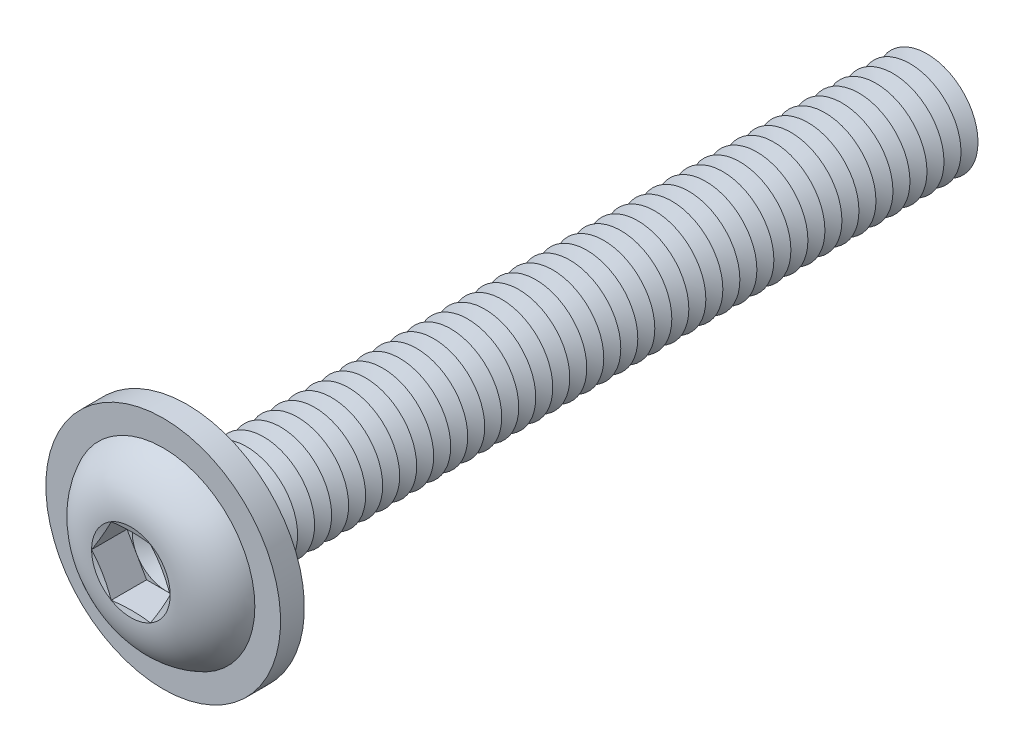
ISO-10303-21;
HEADER;
FILE_DESCRIPTION(('STEP AP214'),'2;1');
FILE_NAME('part.step','',(''),(''),'','','');
FILE_SCHEMA(('AUTOMOTIVE_DESIGN { 1 0 10303 214 1 1 1 1 }'));
ENDSEC;
DATA;
#1=APPLICATION_CONTEXT('core data for automotive mechanical design processes');
#2=APPLICATION_PROTOCOL_DEFINITION('international standard','automotive_design',2000,#1);
#3=PRODUCT_CONTEXT('',#1,'mechanical');
#4=PRODUCT('Part','Part','',(#3));
#5=PRODUCT_RELATED_PRODUCT_CATEGORY('part','',(#4));
#6=PRODUCT_DEFINITION_FORMATION('','',#4);
#7=PRODUCT_DEFINITION_CONTEXT('part definition',#1,'design');
#8=PRODUCT_DEFINITION('design','',#6,#7);
#9=PRODUCT_DEFINITION_SHAPE('','',#8);
#10=(LENGTH_UNIT() NAMED_UNIT(*) SI_UNIT(.MILLI.,.METRE.));
#11=(NAMED_UNIT(*) PLANE_ANGLE_UNIT() SI_UNIT($,.RADIAN.));
#12=(NAMED_UNIT(*) SI_UNIT($,.STERADIAN.) SOLID_ANGLE_UNIT());
#13=UNCERTAINTY_MEASURE_WITH_UNIT(LENGTH_MEASURE(1.E-05),#10,'distance_accuracy_value','');
#14=(GEOMETRIC_REPRESENTATION_CONTEXT(3) GLOBAL_UNCERTAINTY_ASSIGNED_CONTEXT((#13)) GLOBAL_UNIT_ASSIGNED_CONTEXT((#10,
#11,#12)) REPRESENTATION_CONTEXT('',''));
#15=CARTESIAN_POINT('',(0.,0.,0.));
#16=DIRECTION('',(0.,0.,1.));
#17=DIRECTION('',(1.,0.,0.));
#18=AXIS2_PLACEMENT_3D('',#15,#16,#17);
#19=CARTESIAN_POINT('',(0.,0.,-20.25));
#20=DIRECTION('',(0.,0.,1.));
#21=DIRECTION('',(1.,0.,0.));
#22=AXIS2_PLACEMENT_3D('',#19,#20,#21);
#23=CONICAL_SURFACE('',#22,1.50000000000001,1.0471975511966);
#24=CARTESIAN_POINT('',(0.,0.,-20.5));
#25=DIRECTION('',(0.,0.,1.));
#26=DIRECTION('',(1.,0.,0.));
#27=AXIS2_PLACEMENT_3D('',#24,#25,#26);
#28=CIRCLE('',#27,1.06698729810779);
#29=CARTESIAN_POINT('',(1.06698729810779,0.,-20.5));
#30=VERTEX_POINT('',#29);
#31=EDGE_CURVE('E562',#30,#30,#28,.T.);
#32=ORIENTED_EDGE('',*,*,#31,.T.);
#33=EDGE_LOOP('',(#32));
#34=FACE_BOUND('',#33,.T.);
#35=CARTESIAN_POINT('',(0.,0.,-20.25));
#36=DIRECTION('',(0.,0.,1.));
#37=DIRECTION('',(1.,0.,0.));
#38=AXIS2_PLACEMENT_3D('',#35,#36,#37);
#39=CIRCLE('',#38,1.50000000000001);
#40=CARTESIAN_POINT('',(1.50000000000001,0.,-20.25));
#41=VERTEX_POINT('',#40);
#42=EDGE_CURVE('E558',#41,#41,#39,.T.);
#43=ORIENTED_EDGE('',*,*,#42,.F.);
#44=EDGE_LOOP('',(#43));
#45=FACE_BOUND('',#44,.T.);
#46=ADVANCED_FACE('F39',(#34,#45),#23,.T.);
#47=CARTESIAN_POINT('',(0.,0.,-20.5));
#48=DIRECTION('',(0.,0.,-1.));
#49=DIRECTION('',(-1.,0.,0.));
#50=AXIS2_PLACEMENT_3D('',#47,#48,#49);
#51=CONICAL_SURFACE('',#50,1.06698729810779,1.0471975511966);
#52=CARTESIAN_POINT('',(0.,0.,-20.75));
#53=DIRECTION('',(0.,0.,1.));
#54=DIRECTION('',(1.,0.,0.));
#55=AXIS2_PLACEMENT_3D('',#52,#53,#54);
#56=CIRCLE('',#55,1.50000000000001);
#57=CARTESIAN_POINT('',(1.50000000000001,0.,-20.75));
#58=VERTEX_POINT('',#57);
#59=EDGE_CURVE('E566',#58,#58,#56,.T.);
#60=ORIENTED_EDGE('',*,*,#59,.T.);
#61=EDGE_LOOP('',(#60));
#62=FACE_BOUND('',#61,.T.);
#63=ORIENTED_EDGE('',*,*,#31,.F.);
#64=EDGE_LOOP('',(#63));
#65=FACE_BOUND('',#64,.T.);
#66=ADVANCED_FACE('F683',(#62,#65),#51,.T.);
#67=CARTESIAN_POINT('',(0.,1.50000000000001,-22.));
#68=DIRECTION('',(0.,0.,-1.));
#69=DIRECTION('',(-1.,0.,0.));
#70=AXIS2_PLACEMENT_3D('',#67,#68,#69);
#71=PLANE('',#70);
#72=CARTESIAN_POINT('',(0.,0.,-22.));
#73=DIRECTION('',(0.,0.,1.));
#74=DIRECTION('',(1.,0.,0.));
#75=AXIS2_PLACEMENT_3D('',#72,#73,#74);
#76=CIRCLE('',#75,1.06698729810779);
#77=CARTESIAN_POINT('',(1.06698729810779,0.,-22.));
#78=VERTEX_POINT('',#77);
#79=EDGE_CURVE('E585',#78,#78,#76,.T.);
#80=ORIENTED_EDGE('',*,*,#79,.F.);
#81=EDGE_LOOP('',(#80));
#82=FACE_BOUND('',#81,.T.);
#83=ADVANCED_FACE('F689',(#82),#71,.T.);
#84=CARTESIAN_POINT('',(0.,0.,-21.75));
#85=DIRECTION('',(0.,0.,1.));
#86=DIRECTION('',(1.,0.,0.));
#87=AXIS2_PLACEMENT_3D('',#84,#85,#86);
#88=CONICAL_SURFACE('',#87,1.50000000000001,1.0471975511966);
#89=ORIENTED_EDGE('',*,*,#79,.T.);
#90=EDGE_LOOP('',(#89));
#91=FACE_BOUND('',#90,.T.);
#92=CARTESIAN_POINT('',(0.,0.,-21.75));
#93=DIRECTION('',(0.,0.,1.));
#94=DIRECTION('',(1.,0.,0.));
#95=AXIS2_PLACEMENT_3D('',#92,#93,#94);
#96=CIRCLE('',#95,1.50000000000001);
#97=CARTESIAN_POINT('',(1.50000000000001,0.,-21.75));
#98=VERTEX_POINT('',#97);
#99=EDGE_CURVE('E581',#98,#98,#96,.T.);
#100=ORIENTED_EDGE('',*,*,#99,.F.);
#101=EDGE_LOOP('',(#100));
#102=FACE_BOUND('',#101,.T.);
#103=ADVANCED_FACE('F708',(#91,#102),#88,.T.);
#104=CARTESIAN_POINT('',(0.,0.,-21.5));
#105=DIRECTION('',(0.,0.,-1.));
#106=DIRECTION('',(-1.,0.,0.));
#107=AXIS2_PLACEMENT_3D('',#104,#105,#106);
#108=CONICAL_SURFACE('',#107,1.06698729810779,1.0471975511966);
#109=ORIENTED_EDGE('',*,*,#99,.T.);
#110=EDGE_LOOP('',(#109));
#111=FACE_BOUND('',#110,.T.);
#112=CARTESIAN_POINT('',(0.,0.,-21.5));
#113=DIRECTION('',(0.,0.,1.));
#114=DIRECTION('',(1.,0.,0.));
#115=AXIS2_PLACEMENT_3D('',#112,#113,#114);
#116=CIRCLE('',#115,1.06698729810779);
#117=CARTESIAN_POINT('',(1.06698729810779,0.,-21.5));
#118=VERTEX_POINT('',#117);
#119=EDGE_CURVE('E577',#118,#118,#116,.T.);
#120=ORIENTED_EDGE('',*,*,#119,.F.);
#121=EDGE_LOOP('',(#120));
#122=FACE_BOUND('',#121,.T.);
#123=ADVANCED_FACE('F705',(#111,#122),#108,.T.);
#124=CARTESIAN_POINT('',(0.,0.,-21.25));
#125=DIRECTION('',(0.,0.,1.));
#126=DIRECTION('',(1.,0.,0.));
#127=AXIS2_PLACEMENT_3D('',#124,#125,#126);
#128=CONICAL_SURFACE('',#127,1.50000000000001,1.0471975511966);
#129=ORIENTED_EDGE('',*,*,#119,.T.);
#130=EDGE_LOOP('',(#129));
#131=FACE_BOUND('',#130,.T.);
#132=CARTESIAN_POINT('',(0.,0.,-21.25));
#133=DIRECTION('',(0.,0.,1.));
#134=DIRECTION('',(1.,0.,0.));
#135=AXIS2_PLACEMENT_3D('',#132,#133,#134);
#136=CIRCLE('',#135,1.50000000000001);
#137=CARTESIAN_POINT('',(1.50000000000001,0.,-21.25));
#138=VERTEX_POINT('',#137);
#139=EDGE_CURVE('E573',#138,#138,#136,.T.);
#140=ORIENTED_EDGE('',*,*,#139,.F.);
#141=EDGE_LOOP('',(#140));
#142=FACE_BOUND('',#141,.T.);
#143=ADVANCED_FACE('F699',(#131,#142),#128,.T.);
#144=CARTESIAN_POINT('',(0.,0.,-21.));
#145=DIRECTION('',(0.,0.,-1.));
#146=DIRECTION('',(-1.,0.,0.));
#147=AXIS2_PLACEMENT_3D('',#144,#145,#146);
#148=CONICAL_SURFACE('',#147,1.06698729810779,1.0471975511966);
#149=ORIENTED_EDGE('',*,*,#139,.T.);
#150=EDGE_LOOP('',(#149));
#151=FACE_BOUND('',#150,.T.);
#152=CARTESIAN_POINT('',(0.,0.,-21.));
#153=DIRECTION('',(0.,0.,1.));
#154=DIRECTION('',(1.,0.,0.));
#155=AXIS2_PLACEMENT_3D('',#152,#153,#154);
#156=CIRCLE('',#155,1.06698729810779);
#157=CARTESIAN_POINT('',(1.06698729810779,0.,-21.));
#158=VERTEX_POINT('',#157);
#159=EDGE_CURVE('E569',#158,#158,#156,.T.);
#160=ORIENTED_EDGE('',*,*,#159,.F.);
#161=EDGE_LOOP('',(#160));
#162=FACE_BOUND('',#161,.T.);
#163=ADVANCED_FACE('F695',(#151,#162),#148,.T.);
#164=CARTESIAN_POINT('',(0.,0.,-20.75));
#165=DIRECTION('',(0.,0.,1.));
#166=DIRECTION('',(1.,0.,0.));
#167=AXIS2_PLACEMENT_3D('',#164,#165,#166);
#168=CONICAL_SURFACE('',#167,1.50000000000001,1.0471975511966);
#169=ORIENTED_EDGE('',*,*,#159,.T.);
#170=EDGE_LOOP('',(#169));
#171=FACE_BOUND('',#170,.T.);
#172=ORIENTED_EDGE('',*,*,#59,.F.);
#173=EDGE_LOOP('',(#172));
#174=FACE_BOUND('',#173,.T.);
#175=ADVANCED_FACE('F698',(#171,#174),#168,.T.);
#176=CARTESIAN_POINT('',(0.,0.,-19.75));
#177=DIRECTION('',(0.,0.,1.));
#178=DIRECTION('',(1.,0.,0.));
#179=AXIS2_PLACEMENT_3D('',#176,#177,#178);
#180=CONICAL_SURFACE('',#179,1.50000000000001,1.0471975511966);
#181=CARTESIAN_POINT('',(0.,0.,-20.));
#182=DIRECTION('',(0.,0.,1.));
#183=DIRECTION('',(1.,0.,0.));
#184=AXIS2_PLACEMENT_3D('',#181,#182,#183);
#185=CIRCLE('',#184,1.06698729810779);
#186=CARTESIAN_POINT('',(1.06698729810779,0.,-20.));
#187=VERTEX_POINT('',#186);
#188=EDGE_CURVE('E554',#187,#187,#185,.T.);
#189=ORIENTED_EDGE('',*,*,#188,.T.);
#190=EDGE_LOOP('',(#189));
#191=FACE_BOUND('',#190,.T.);
#192=CARTESIAN_POINT('',(0.,0.,-19.75));
#193=DIRECTION('',(0.,0.,1.));
#194=DIRECTION('',(1.,0.,0.));
#195=AXIS2_PLACEMENT_3D('',#192,#193,#194);
#196=CIRCLE('',#195,1.50000000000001);
#197=CARTESIAN_POINT('',(1.50000000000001,0.,-19.75));
#198=VERTEX_POINT('',#197);
#199=EDGE_CURVE('E550',#198,#198,#196,.T.);
#200=ORIENTED_EDGE('',*,*,#199,.F.);
#201=EDGE_LOOP('',(#200));
#202=FACE_BOUND('',#201,.T.);
#203=ADVANCED_FACE('F703',(#191,#202),#180,.T.);
#204=CARTESIAN_POINT('',(0.,0.,-20.));
#205=DIRECTION('',(0.,0.,-1.));
#206=DIRECTION('',(-1.,0.,0.));
#207=AXIS2_PLACEMENT_3D('',#204,#205,#206);
#208=CONICAL_SURFACE('',#207,1.06698729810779,1.0471975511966);
#209=ORIENTED_EDGE('',*,*,#42,.T.);
#210=EDGE_LOOP('',(#209));
#211=FACE_BOUND('',#210,.T.);
#212=ORIENTED_EDGE('',*,*,#188,.F.);
#213=EDGE_LOOP('',(#212));
#214=FACE_BOUND('',#213,.T.);
#215=ADVANCED_FACE('F754',(#211,#214),#208,.T.);
#216=CARTESIAN_POINT('',(0.,0.,-19.25));
#217=DIRECTION('',(0.,0.,1.));
#218=DIRECTION('',(1.,0.,0.));
#219=AXIS2_PLACEMENT_3D('',#216,#217,#218);
#220=CONICAL_SURFACE('',#219,1.50000000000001,1.0471975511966);
#221=CARTESIAN_POINT('',(0.,0.,-19.5));
#222=DIRECTION('',(0.,0.,1.));
#223=DIRECTION('',(1.,0.,0.));
#224=AXIS2_PLACEMENT_3D('',#221,#222,#223);
#225=CIRCLE('',#224,1.06698729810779);
#226=CARTESIAN_POINT('',(1.06698729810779,0.,-19.5));
#227=VERTEX_POINT('',#226);
#228=EDGE_CURVE('E546',#227,#227,#225,.T.);
#229=ORIENTED_EDGE('',*,*,#228,.T.);
#230=EDGE_LOOP('',(#229));
#231=FACE_BOUND('',#230,.T.);
#232=CARTESIAN_POINT('',(0.,0.,-19.25));
#233=DIRECTION('',(0.,0.,1.));
#234=DIRECTION('',(1.,0.,0.));
#235=AXIS2_PLACEMENT_3D('',#232,#233,#234);
#236=CIRCLE('',#235,1.50000000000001);
#237=CARTESIAN_POINT('',(1.50000000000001,0.,-19.25));
#238=VERTEX_POINT('',#237);
#239=EDGE_CURVE('E542',#238,#238,#236,.T.);
#240=ORIENTED_EDGE('',*,*,#239,.F.);
#241=EDGE_LOOP('',(#240));
#242=FACE_BOUND('',#241,.T.);
#243=ADVANCED_FACE('F760',(#231,#242),#220,.T.);
#244=CARTESIAN_POINT('',(0.,0.,-19.5));
#245=DIRECTION('',(0.,0.,-1.));
#246=DIRECTION('',(-1.,0.,0.));
#247=AXIS2_PLACEMENT_3D('',#244,#245,#246);
#248=CONICAL_SURFACE('',#247,1.06698729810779,1.0471975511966);
#249=ORIENTED_EDGE('',*,*,#199,.T.);
#250=EDGE_LOOP('',(#249));
#251=FACE_BOUND('',#250,.T.);
#252=ORIENTED_EDGE('',*,*,#228,.F.);
#253=EDGE_LOOP('',(#252));
#254=FACE_BOUND('',#253,.T.);
#255=ADVANCED_FACE('F767',(#251,#254),#248,.T.);
#256=CARTESIAN_POINT('',(0.,0.,-18.75));
#257=DIRECTION('',(0.,0.,1.));
#258=DIRECTION('',(1.,0.,0.));
#259=AXIS2_PLACEMENT_3D('',#256,#257,#258);
#260=CONICAL_SURFACE('',#259,1.50000000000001,1.0471975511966);
#261=CARTESIAN_POINT('',(0.,0.,-19.));
#262=DIRECTION('',(0.,0.,1.));
#263=DIRECTION('',(1.,0.,0.));
#264=AXIS2_PLACEMENT_3D('',#261,#262,#263);
#265=CIRCLE('',#264,1.06698729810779);
#266=CARTESIAN_POINT('',(1.06698729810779,0.,-19.));
#267=VERTEX_POINT('',#266);
#268=EDGE_CURVE('E538',#267,#267,#265,.T.);
#269=ORIENTED_EDGE('',*,*,#268,.T.);
#270=EDGE_LOOP('',(#269));
#271=FACE_BOUND('',#270,.T.);
#272=CARTESIAN_POINT('',(0.,0.,-18.75));
#273=DIRECTION('',(0.,0.,1.));
#274=DIRECTION('',(1.,0.,0.));
#275=AXIS2_PLACEMENT_3D('',#272,#273,#274);
#276=CIRCLE('',#275,1.50000000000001);
#277=CARTESIAN_POINT('',(1.50000000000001,0.,-18.75));
#278=VERTEX_POINT('',#277);
#279=EDGE_CURVE('E534',#278,#278,#276,.T.);
#280=ORIENTED_EDGE('',*,*,#279,.F.);
#281=EDGE_LOOP('',(#280));
#282=FACE_BOUND('',#281,.T.);
#283=ADVANCED_FACE('F774',(#271,#282),#260,.T.);
#284=CARTESIAN_POINT('',(0.,0.,-19.));
#285=DIRECTION('',(0.,0.,-1.));
#286=DIRECTION('',(-1.,0.,0.));
#287=AXIS2_PLACEMENT_3D('',#284,#285,#286);
#288=CONICAL_SURFACE('',#287,1.06698729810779,1.0471975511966);
#289=ORIENTED_EDGE('',*,*,#239,.T.);
#290=EDGE_LOOP('',(#289));
#291=FACE_BOUND('',#290,.T.);
#292=ORIENTED_EDGE('',*,*,#268,.F.);
#293=EDGE_LOOP('',(#292));
#294=FACE_BOUND('',#293,.T.);
#295=ADVANCED_FACE('F781',(#291,#294),#288,.T.);
#296=CARTESIAN_POINT('',(0.,0.,-18.25));
#297=DIRECTION('',(0.,0.,1.));
#298=DIRECTION('',(1.,0.,0.));
#299=AXIS2_PLACEMENT_3D('',#296,#297,#298);
#300=CONICAL_SURFACE('',#299,1.50000000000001,1.0471975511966);
#301=CARTESIAN_POINT('',(0.,0.,-18.5));
#302=DIRECTION('',(0.,0.,1.));
#303=DIRECTION('',(1.,0.,0.));
#304=AXIS2_PLACEMENT_3D('',#301,#302,#303);
#305=CIRCLE('',#304,1.06698729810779);
#306=CARTESIAN_POINT('',(1.06698729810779,0.,-18.5));
#307=VERTEX_POINT('',#306);
#308=EDGE_CURVE('E530',#307,#307,#305,.T.);
#309=ORIENTED_EDGE('',*,*,#308,.T.);
#310=EDGE_LOOP('',(#309));
#311=FACE_BOUND('',#310,.T.);
#312=CARTESIAN_POINT('',(0.,0.,-18.25));
#313=DIRECTION('',(0.,0.,1.));
#314=DIRECTION('',(1.,0.,0.));
#315=AXIS2_PLACEMENT_3D('',#312,#313,#314);
#316=CIRCLE('',#315,1.50000000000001);
#317=CARTESIAN_POINT('',(1.50000000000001,0.,-18.25));
#318=VERTEX_POINT('',#317);
#319=EDGE_CURVE('E526',#318,#318,#316,.T.);
#320=ORIENTED_EDGE('',*,*,#319,.F.);
#321=EDGE_LOOP('',(#320));
#322=FACE_BOUND('',#321,.T.);
#323=ADVANCED_FACE('F788',(#311,#322),#300,.T.);
#324=CARTESIAN_POINT('',(0.,0.,-18.5));
#325=DIRECTION('',(0.,0.,-1.));
#326=DIRECTION('',(-1.,0.,0.));
#327=AXIS2_PLACEMENT_3D('',#324,#325,#326);
#328=CONICAL_SURFACE('',#327,1.06698729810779,1.0471975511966);
#329=ORIENTED_EDGE('',*,*,#279,.T.);
#330=EDGE_LOOP('',(#329));
#331=FACE_BOUND('',#330,.T.);
#332=ORIENTED_EDGE('',*,*,#308,.F.);
#333=EDGE_LOOP('',(#332));
#334=FACE_BOUND('',#333,.T.);
#335=ADVANCED_FACE('F795',(#331,#334),#328,.T.);
#336=CARTESIAN_POINT('',(0.,0.,-17.75));
#337=DIRECTION('',(0.,0.,1.));
#338=DIRECTION('',(1.,0.,0.));
#339=AXIS2_PLACEMENT_3D('',#336,#337,#338);
#340=CONICAL_SURFACE('',#339,1.50000000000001,1.0471975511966);
#341=CARTESIAN_POINT('',(0.,0.,-18.));
#342=DIRECTION('',(0.,0.,1.));
#343=DIRECTION('',(1.,0.,0.));
#344=AXIS2_PLACEMENT_3D('',#341,#342,#343);
#345=CIRCLE('',#344,1.06698729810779);
#346=CARTESIAN_POINT('',(1.06698729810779,0.,-18.));
#347=VERTEX_POINT('',#346);
#348=EDGE_CURVE('E522',#347,#347,#345,.T.);
#349=ORIENTED_EDGE('',*,*,#348,.T.);
#350=EDGE_LOOP('',(#349));
#351=FACE_BOUND('',#350,.T.);
#352=CARTESIAN_POINT('',(0.,0.,-17.75));
#353=DIRECTION('',(0.,0.,1.));
#354=DIRECTION('',(1.,0.,0.));
#355=AXIS2_PLACEMENT_3D('',#352,#353,#354);
#356=CIRCLE('',#355,1.50000000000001);
#357=CARTESIAN_POINT('',(1.50000000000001,0.,-17.75));
#358=VERTEX_POINT('',#357);
#359=EDGE_CURVE('E518',#358,#358,#356,.T.);
#360=ORIENTED_EDGE('',*,*,#359,.F.);
#361=EDGE_LOOP('',(#360));
#362=FACE_BOUND('',#361,.T.);
#363=ADVANCED_FACE('F802',(#351,#362),#340,.T.);
#364=CARTESIAN_POINT('',(0.,0.,-18.));
#365=DIRECTION('',(0.,0.,-1.));
#366=DIRECTION('',(-1.,0.,0.));
#367=AXIS2_PLACEMENT_3D('',#364,#365,#366);
#368=CONICAL_SURFACE('',#367,1.06698729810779,1.0471975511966);
#369=ORIENTED_EDGE('',*,*,#319,.T.);
#370=EDGE_LOOP('',(#369));
#371=FACE_BOUND('',#370,.T.);
#372=ORIENTED_EDGE('',*,*,#348,.F.);
#373=EDGE_LOOP('',(#372));
#374=FACE_BOUND('',#373,.T.);
#375=ADVANCED_FACE('F809',(#371,#374),#368,.T.);
#376=CARTESIAN_POINT('',(0.,0.,-17.25));
#377=DIRECTION('',(0.,0.,1.));
#378=DIRECTION('',(1.,0.,0.));
#379=AXIS2_PLACEMENT_3D('',#376,#377,#378);
#380=CONICAL_SURFACE('',#379,1.50000000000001,1.0471975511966);
#381=CARTESIAN_POINT('',(0.,0.,-17.5));
#382=DIRECTION('',(0.,0.,1.));
#383=DIRECTION('',(1.,0.,0.));
#384=AXIS2_PLACEMENT_3D('',#381,#382,#383);
#385=CIRCLE('',#384,1.06698729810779);
#386=CARTESIAN_POINT('',(1.06698729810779,0.,-17.5));
#387=VERTEX_POINT('',#386);
#388=EDGE_CURVE('E514',#387,#387,#385,.T.);
#389=ORIENTED_EDGE('',*,*,#388,.T.);
#390=EDGE_LOOP('',(#389));
#391=FACE_BOUND('',#390,.T.);
#392=CARTESIAN_POINT('',(0.,0.,-17.25));
#393=DIRECTION('',(0.,0.,1.));
#394=DIRECTION('',(1.,0.,0.));
#395=AXIS2_PLACEMENT_3D('',#392,#393,#394);
#396=CIRCLE('',#395,1.50000000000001);
#397=CARTESIAN_POINT('',(1.50000000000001,0.,-17.25));
#398=VERTEX_POINT('',#397);
#399=EDGE_CURVE('E510',#398,#398,#396,.T.);
#400=ORIENTED_EDGE('',*,*,#399,.F.);
#401=EDGE_LOOP('',(#400));
#402=FACE_BOUND('',#401,.T.);
#403=ADVANCED_FACE('F816',(#391,#402),#380,.T.);
#404=CARTESIAN_POINT('',(0.,0.,-17.5));
#405=DIRECTION('',(0.,0.,-1.));
#406=DIRECTION('',(-1.,0.,0.));
#407=AXIS2_PLACEMENT_3D('',#404,#405,#406);
#408=CONICAL_SURFACE('',#407,1.06698729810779,1.0471975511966);
#409=ORIENTED_EDGE('',*,*,#359,.T.);
#410=EDGE_LOOP('',(#409));
#411=FACE_BOUND('',#410,.T.);
#412=ORIENTED_EDGE('',*,*,#388,.F.);
#413=EDGE_LOOP('',(#412));
#414=FACE_BOUND('',#413,.T.);
#415=ADVANCED_FACE('F823',(#411,#414),#408,.T.);
#416=CARTESIAN_POINT('',(0.,0.,-16.75));
#417=DIRECTION('',(0.,0.,1.));
#418=DIRECTION('',(1.,0.,0.));
#419=AXIS2_PLACEMENT_3D('',#416,#417,#418);
#420=CONICAL_SURFACE('',#419,1.50000000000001,1.0471975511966);
#421=CARTESIAN_POINT('',(0.,0.,-17.));
#422=DIRECTION('',(0.,0.,1.));
#423=DIRECTION('',(1.,0.,0.));
#424=AXIS2_PLACEMENT_3D('',#421,#422,#423);
#425=CIRCLE('',#424,1.06698729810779);
#426=CARTESIAN_POINT('',(1.06698729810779,0.,-17.));
#427=VERTEX_POINT('',#426);
#428=EDGE_CURVE('E506',#427,#427,#425,.T.);
#429=ORIENTED_EDGE('',*,*,#428,.T.);
#430=EDGE_LOOP('',(#429));
#431=FACE_BOUND('',#430,.T.);
#432=CARTESIAN_POINT('',(0.,0.,-16.75));
#433=DIRECTION('',(0.,0.,1.));
#434=DIRECTION('',(1.,0.,0.));
#435=AXIS2_PLACEMENT_3D('',#432,#433,#434);
#436=CIRCLE('',#435,1.50000000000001);
#437=CARTESIAN_POINT('',(1.50000000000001,0.,-16.75));
#438=VERTEX_POINT('',#437);
#439=EDGE_CURVE('E502',#438,#438,#436,.T.);
#440=ORIENTED_EDGE('',*,*,#439,.F.);
#441=EDGE_LOOP('',(#440));
#442=FACE_BOUND('',#441,.T.);
#443=ADVANCED_FACE('F830',(#431,#442),#420,.T.);
#444=CARTESIAN_POINT('',(0.,0.,-17.));
#445=DIRECTION('',(0.,0.,-1.));
#446=DIRECTION('',(-1.,0.,0.));
#447=AXIS2_PLACEMENT_3D('',#444,#445,#446);
#448=CONICAL_SURFACE('',#447,1.06698729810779,1.0471975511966);
#449=ORIENTED_EDGE('',*,*,#399,.T.);
#450=EDGE_LOOP('',(#449));
#451=FACE_BOUND('',#450,.T.);
#452=ORIENTED_EDGE('',*,*,#428,.F.);
#453=EDGE_LOOP('',(#452));
#454=FACE_BOUND('',#453,.T.);
#455=ADVANCED_FACE('F837',(#451,#454),#448,.T.);
#456=CARTESIAN_POINT('',(0.,0.,-16.25));
#457=DIRECTION('',(0.,0.,1.));
#458=DIRECTION('',(1.,0.,0.));
#459=AXIS2_PLACEMENT_3D('',#456,#457,#458);
#460=CONICAL_SURFACE('',#459,1.50000000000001,1.0471975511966);
#461=CARTESIAN_POINT('',(0.,0.,-16.5));
#462=DIRECTION('',(0.,0.,1.));
#463=DIRECTION('',(1.,0.,0.));
#464=AXIS2_PLACEMENT_3D('',#461,#462,#463);
#465=CIRCLE('',#464,1.06698729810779);
#466=CARTESIAN_POINT('',(1.06698729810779,0.,-16.5));
#467=VERTEX_POINT('',#466);
#468=EDGE_CURVE('E498',#467,#467,#465,.T.);
#469=ORIENTED_EDGE('',*,*,#468,.T.);
#470=EDGE_LOOP('',(#469));
#471=FACE_BOUND('',#470,.T.);
#472=CARTESIAN_POINT('',(0.,0.,-16.25));
#473=DIRECTION('',(0.,0.,1.));
#474=DIRECTION('',(1.,0.,0.));
#475=AXIS2_PLACEMENT_3D('',#472,#473,#474);
#476=CIRCLE('',#475,1.50000000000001);
#477=CARTESIAN_POINT('',(1.50000000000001,0.,-16.25));
#478=VERTEX_POINT('',#477);
#479=EDGE_CURVE('E494',#478,#478,#476,.T.);
#480=ORIENTED_EDGE('',*,*,#479,.F.);
#481=EDGE_LOOP('',(#480));
#482=FACE_BOUND('',#481,.T.);
#483=ADVANCED_FACE('F844',(#471,#482),#460,.T.);
#484=CARTESIAN_POINT('',(0.,0.,-16.5));
#485=DIRECTION('',(0.,0.,-1.));
#486=DIRECTION('',(-1.,0.,0.));
#487=AXIS2_PLACEMENT_3D('',#484,#485,#486);
#488=CONICAL_SURFACE('',#487,1.06698729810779,1.0471975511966);
#489=ORIENTED_EDGE('',*,*,#439,.T.);
#490=EDGE_LOOP('',(#489));
#491=FACE_BOUND('',#490,.T.);
#492=ORIENTED_EDGE('',*,*,#468,.F.);
#493=EDGE_LOOP('',(#492));
#494=FACE_BOUND('',#493,.T.);
#495=ADVANCED_FACE('F851',(#491,#494),#488,.T.);
#496=CARTESIAN_POINT('',(0.,0.,-15.75));
#497=DIRECTION('',(0.,0.,1.));
#498=DIRECTION('',(1.,0.,0.));
#499=AXIS2_PLACEMENT_3D('',#496,#497,#498);
#500=CONICAL_SURFACE('',#499,1.50000000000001,1.0471975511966);
#501=CARTESIAN_POINT('',(0.,0.,-16.));
#502=DIRECTION('',(0.,0.,1.));
#503=DIRECTION('',(1.,0.,0.));
#504=AXIS2_PLACEMENT_3D('',#501,#502,#503);
#505=CIRCLE('',#504,1.06698729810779);
#506=CARTESIAN_POINT('',(1.06698729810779,0.,-16.));
#507=VERTEX_POINT('',#506);
#508=EDGE_CURVE('E490',#507,#507,#505,.T.);
#509=ORIENTED_EDGE('',*,*,#508,.T.);
#510=EDGE_LOOP('',(#509));
#511=FACE_BOUND('',#510,.T.);
#512=CARTESIAN_POINT('',(0.,0.,-15.75));
#513=DIRECTION('',(0.,0.,1.));
#514=DIRECTION('',(1.,0.,0.));
#515=AXIS2_PLACEMENT_3D('',#512,#513,#514);
#516=CIRCLE('',#515,1.50000000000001);
#517=CARTESIAN_POINT('',(1.50000000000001,0.,-15.75));
#518=VERTEX_POINT('',#517);
#519=EDGE_CURVE('E486',#518,#518,#516,.T.);
#520=ORIENTED_EDGE('',*,*,#519,.F.);
#521=EDGE_LOOP('',(#520));
#522=FACE_BOUND('',#521,.T.);
#523=ADVANCED_FACE('F858',(#511,#522),#500,.T.);
#524=CARTESIAN_POINT('',(0.,0.,-16.));
#525=DIRECTION('',(0.,0.,-1.));
#526=DIRECTION('',(-1.,0.,0.));
#527=AXIS2_PLACEMENT_3D('',#524,#525,#526);
#528=CONICAL_SURFACE('',#527,1.06698729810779,1.0471975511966);
#529=ORIENTED_EDGE('',*,*,#479,.T.);
#530=EDGE_LOOP('',(#529));
#531=FACE_BOUND('',#530,.T.);
#532=ORIENTED_EDGE('',*,*,#508,.F.);
#533=EDGE_LOOP('',(#532));
#534=FACE_BOUND('',#533,.T.);
#535=ADVANCED_FACE('F865',(#531,#534),#528,.T.);
#536=CARTESIAN_POINT('',(0.,0.,-15.25));
#537=DIRECTION('',(0.,0.,1.));
#538=DIRECTION('',(1.,0.,0.));
#539=AXIS2_PLACEMENT_3D('',#536,#537,#538);
#540=CONICAL_SURFACE('',#539,1.50000000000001,1.0471975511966);
#541=CARTESIAN_POINT('',(0.,0.,-15.5));
#542=DIRECTION('',(0.,0.,1.));
#543=DIRECTION('',(1.,0.,0.));
#544=AXIS2_PLACEMENT_3D('',#541,#542,#543);
#545=CIRCLE('',#544,1.06698729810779);
#546=CARTESIAN_POINT('',(1.06698729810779,0.,-15.5));
#547=VERTEX_POINT('',#546);
#548=EDGE_CURVE('E482',#547,#547,#545,.T.);
#549=ORIENTED_EDGE('',*,*,#548,.T.);
#550=EDGE_LOOP('',(#549));
#551=FACE_BOUND('',#550,.T.);
#552=CARTESIAN_POINT('',(0.,0.,-15.25));
#553=DIRECTION('',(0.,0.,1.));
#554=DIRECTION('',(1.,0.,0.));
#555=AXIS2_PLACEMENT_3D('',#552,#553,#554);
#556=CIRCLE('',#555,1.50000000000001);
#557=CARTESIAN_POINT('',(1.50000000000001,0.,-15.25));
#558=VERTEX_POINT('',#557);
#559=EDGE_CURVE('E478',#558,#558,#556,.T.);
#560=ORIENTED_EDGE('',*,*,#559,.F.);
#561=EDGE_LOOP('',(#560));
#562=FACE_BOUND('',#561,.T.);
#563=ADVANCED_FACE('F872',(#551,#562),#540,.T.);
#564=CARTESIAN_POINT('',(0.,0.,-15.5));
#565=DIRECTION('',(0.,0.,-1.));
#566=DIRECTION('',(-1.,0.,0.));
#567=AXIS2_PLACEMENT_3D('',#564,#565,#566);
#568=CONICAL_SURFACE('',#567,1.06698729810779,1.0471975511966);
#569=ORIENTED_EDGE('',*,*,#519,.T.);
#570=EDGE_LOOP('',(#569));
#571=FACE_BOUND('',#570,.T.);
#572=ORIENTED_EDGE('',*,*,#548,.F.);
#573=EDGE_LOOP('',(#572));
#574=FACE_BOUND('',#573,.T.);
#575=ADVANCED_FACE('F879',(#571,#574),#568,.T.);
#576=CARTESIAN_POINT('',(0.,0.,-14.75));
#577=DIRECTION('',(0.,0.,1.));
#578=DIRECTION('',(1.,0.,0.));
#579=AXIS2_PLACEMENT_3D('',#576,#577,#578);
#580=CONICAL_SURFACE('',#579,1.50000000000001,1.0471975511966);
#581=CARTESIAN_POINT('',(0.,0.,-15.));
#582=DIRECTION('',(0.,0.,1.));
#583=DIRECTION('',(1.,0.,0.));
#584=AXIS2_PLACEMENT_3D('',#581,#582,#583);
#585=CIRCLE('',#584,1.06698729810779);
#586=CARTESIAN_POINT('',(1.06698729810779,0.,-15.));
#587=VERTEX_POINT('',#586);
#588=EDGE_CURVE('E474',#587,#587,#585,.T.);
#589=ORIENTED_EDGE('',*,*,#588,.T.);
#590=EDGE_LOOP('',(#589));
#591=FACE_BOUND('',#590,.T.);
#592=CARTESIAN_POINT('',(0.,0.,-14.75));
#593=DIRECTION('',(0.,0.,1.));
#594=DIRECTION('',(1.,0.,0.));
#595=AXIS2_PLACEMENT_3D('',#592,#593,#594);
#596=CIRCLE('',#595,1.50000000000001);
#597=CARTESIAN_POINT('',(1.50000000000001,0.,-14.75));
#598=VERTEX_POINT('',#597);
#599=EDGE_CURVE('E470',#598,#598,#596,.T.);
#600=ORIENTED_EDGE('',*,*,#599,.F.);
#601=EDGE_LOOP('',(#600));
#602=FACE_BOUND('',#601,.T.);
#603=ADVANCED_FACE('F886',(#591,#602),#580,.T.);
#604=CARTESIAN_POINT('',(0.,0.,-15.));
#605=DIRECTION('',(0.,0.,-1.));
#606=DIRECTION('',(-1.,0.,0.));
#607=AXIS2_PLACEMENT_3D('',#604,#605,#606);
#608=CONICAL_SURFACE('',#607,1.06698729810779,1.0471975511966);
#609=ORIENTED_EDGE('',*,*,#559,.T.);
#610=EDGE_LOOP('',(#609));
#611=FACE_BOUND('',#610,.T.);
#612=ORIENTED_EDGE('',*,*,#588,.F.);
#613=EDGE_LOOP('',(#612));
#614=FACE_BOUND('',#613,.T.);
#615=ADVANCED_FACE('F893',(#611,#614),#608,.T.);
#616=CARTESIAN_POINT('',(0.,0.,-14.25));
#617=DIRECTION('',(0.,0.,1.));
#618=DIRECTION('',(1.,0.,0.));
#619=AXIS2_PLACEMENT_3D('',#616,#617,#618);
#620=CONICAL_SURFACE('',#619,1.50000000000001,1.0471975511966);
#621=CARTESIAN_POINT('',(0.,0.,-14.5));
#622=DIRECTION('',(0.,0.,1.));
#623=DIRECTION('',(1.,0.,0.));
#624=AXIS2_PLACEMENT_3D('',#621,#622,#623);
#625=CIRCLE('',#624,1.06698729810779);
#626=CARTESIAN_POINT('',(1.06698729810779,0.,-14.5));
#627=VERTEX_POINT('',#626);
#628=EDGE_CURVE('E466',#627,#627,#625,.T.);
#629=ORIENTED_EDGE('',*,*,#628,.T.);
#630=EDGE_LOOP('',(#629));
#631=FACE_BOUND('',#630,.T.);
#632=CARTESIAN_POINT('',(0.,0.,-14.25));
#633=DIRECTION('',(0.,0.,1.));
#634=DIRECTION('',(1.,0.,0.));
#635=AXIS2_PLACEMENT_3D('',#632,#633,#634);
#636=CIRCLE('',#635,1.50000000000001);
#637=CARTESIAN_POINT('',(1.50000000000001,0.,-14.25));
#638=VERTEX_POINT('',#637);
#639=EDGE_CURVE('E462',#638,#638,#636,.T.);
#640=ORIENTED_EDGE('',*,*,#639,.F.);
#641=EDGE_LOOP('',(#640));
#642=FACE_BOUND('',#641,.T.);
#643=ADVANCED_FACE('F900',(#631,#642),#620,.T.);
#644=CARTESIAN_POINT('',(0.,0.,-14.5));
#645=DIRECTION('',(0.,0.,-1.));
#646=DIRECTION('',(-1.,0.,0.));
#647=AXIS2_PLACEMENT_3D('',#644,#645,#646);
#648=CONICAL_SURFACE('',#647,1.06698729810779,1.0471975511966);
#649=ORIENTED_EDGE('',*,*,#599,.T.);
#650=EDGE_LOOP('',(#649));
#651=FACE_BOUND('',#650,.T.);
#652=ORIENTED_EDGE('',*,*,#628,.F.);
#653=EDGE_LOOP('',(#652));
#654=FACE_BOUND('',#653,.T.);
#655=ADVANCED_FACE('F907',(#651,#654),#648,.T.);
#656=CARTESIAN_POINT('',(0.,0.,-13.75));
#657=DIRECTION('',(0.,0.,1.));
#658=DIRECTION('',(1.,0.,0.));
#659=AXIS2_PLACEMENT_3D('',#656,#657,#658);
#660=CONICAL_SURFACE('',#659,1.50000000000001,1.0471975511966);
#661=CARTESIAN_POINT('',(0.,0.,-14.));
#662=DIRECTION('',(0.,0.,1.));
#663=DIRECTION('',(1.,0.,0.));
#664=AXIS2_PLACEMENT_3D('',#661,#662,#663);
#665=CIRCLE('',#664,1.06698729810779);
#666=CARTESIAN_POINT('',(1.06698729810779,0.,-14.));
#667=VERTEX_POINT('',#666);
#668=EDGE_CURVE('E458',#667,#667,#665,.T.);
#669=ORIENTED_EDGE('',*,*,#668,.T.);
#670=EDGE_LOOP('',(#669));
#671=FACE_BOUND('',#670,.T.);
#672=CARTESIAN_POINT('',(0.,0.,-13.75));
#673=DIRECTION('',(0.,0.,1.));
#674=DIRECTION('',(1.,0.,0.));
#675=AXIS2_PLACEMENT_3D('',#672,#673,#674);
#676=CIRCLE('',#675,1.50000000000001);
#677=CARTESIAN_POINT('',(1.50000000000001,0.,-13.75));
#678=VERTEX_POINT('',#677);
#679=EDGE_CURVE('E454',#678,#678,#676,.T.);
#680=ORIENTED_EDGE('',*,*,#679,.F.);
#681=EDGE_LOOP('',(#680));
#682=FACE_BOUND('',#681,.T.);
#683=ADVANCED_FACE('F914',(#671,#682),#660,.T.);
#684=CARTESIAN_POINT('',(0.,0.,-14.));
#685=DIRECTION('',(0.,0.,-1.));
#686=DIRECTION('',(-1.,0.,0.));
#687=AXIS2_PLACEMENT_3D('',#684,#685,#686);
#688=CONICAL_SURFACE('',#687,1.06698729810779,1.0471975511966);
#689=ORIENTED_EDGE('',*,*,#639,.T.);
#690=EDGE_LOOP('',(#689));
#691=FACE_BOUND('',#690,.T.);
#692=ORIENTED_EDGE('',*,*,#668,.F.);
#693=EDGE_LOOP('',(#692));
#694=FACE_BOUND('',#693,.T.);
#695=ADVANCED_FACE('F921',(#691,#694),#688,.T.);
#696=CARTESIAN_POINT('',(0.,0.,-13.25));
#697=DIRECTION('',(0.,0.,1.));
#698=DIRECTION('',(1.,0.,0.));
#699=AXIS2_PLACEMENT_3D('',#696,#697,#698);
#700=CONICAL_SURFACE('',#699,1.50000000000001,1.0471975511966);
#701=CARTESIAN_POINT('',(0.,0.,-13.5));
#702=DIRECTION('',(0.,0.,1.));
#703=DIRECTION('',(1.,0.,0.));
#704=AXIS2_PLACEMENT_3D('',#701,#702,#703);
#705=CIRCLE('',#704,1.06698729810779);
#706=CARTESIAN_POINT('',(1.06698729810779,0.,-13.5));
#707=VERTEX_POINT('',#706);
#708=EDGE_CURVE('E450',#707,#707,#705,.T.);
#709=ORIENTED_EDGE('',*,*,#708,.T.);
#710=EDGE_LOOP('',(#709));
#711=FACE_BOUND('',#710,.T.);
#712=CARTESIAN_POINT('',(0.,0.,-13.25));
#713=DIRECTION('',(0.,0.,1.));
#714=DIRECTION('',(1.,0.,0.));
#715=AXIS2_PLACEMENT_3D('',#712,#713,#714);
#716=CIRCLE('',#715,1.50000000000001);
#717=CARTESIAN_POINT('',(1.50000000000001,0.,-13.25));
#718=VERTEX_POINT('',#717);
#719=EDGE_CURVE('E446',#718,#718,#716,.T.);
#720=ORIENTED_EDGE('',*,*,#719,.F.);
#721=EDGE_LOOP('',(#720));
#722=FACE_BOUND('',#721,.T.);
#723=ADVANCED_FACE('F928',(#711,#722),#700,.T.);
#724=CARTESIAN_POINT('',(0.,0.,-13.5));
#725=DIRECTION('',(0.,0.,-1.));
#726=DIRECTION('',(-1.,0.,0.));
#727=AXIS2_PLACEMENT_3D('',#724,#725,#726);
#728=CONICAL_SURFACE('',#727,1.06698729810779,1.0471975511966);
#729=ORIENTED_EDGE('',*,*,#679,.T.);
#730=EDGE_LOOP('',(#729));
#731=FACE_BOUND('',#730,.T.);
#732=ORIENTED_EDGE('',*,*,#708,.F.);
#733=EDGE_LOOP('',(#732));
#734=FACE_BOUND('',#733,.T.);
#735=ADVANCED_FACE('F935',(#731,#734),#728,.T.);
#736=CARTESIAN_POINT('',(0.,0.,-12.75));
#737=DIRECTION('',(0.,0.,1.));
#738=DIRECTION('',(1.,0.,0.));
#739=AXIS2_PLACEMENT_3D('',#736,#737,#738);
#740=CONICAL_SURFACE('',#739,1.50000000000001,1.0471975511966);
#741=CARTESIAN_POINT('',(0.,0.,-13.));
#742=DIRECTION('',(0.,0.,1.));
#743=DIRECTION('',(1.,0.,0.));
#744=AXIS2_PLACEMENT_3D('',#741,#742,#743);
#745=CIRCLE('',#744,1.06698729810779);
#746=CARTESIAN_POINT('',(1.06698729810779,0.,-13.));
#747=VERTEX_POINT('',#746);
#748=EDGE_CURVE('E442',#747,#747,#745,.T.);
#749=ORIENTED_EDGE('',*,*,#748,.T.);
#750=EDGE_LOOP('',(#749));
#751=FACE_BOUND('',#750,.T.);
#752=CARTESIAN_POINT('',(0.,0.,-12.75));
#753=DIRECTION('',(0.,0.,1.));
#754=DIRECTION('',(1.,0.,0.));
#755=AXIS2_PLACEMENT_3D('',#752,#753,#754);
#756=CIRCLE('',#755,1.50000000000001);
#757=CARTESIAN_POINT('',(1.50000000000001,0.,-12.75));
#758=VERTEX_POINT('',#757);
#759=EDGE_CURVE('E438',#758,#758,#756,.T.);
#760=ORIENTED_EDGE('',*,*,#759,.F.);
#761=EDGE_LOOP('',(#760));
#762=FACE_BOUND('',#761,.T.);
#763=ADVANCED_FACE('F942',(#751,#762),#740,.T.);
#764=CARTESIAN_POINT('',(0.,0.,-13.));
#765=DIRECTION('',(0.,0.,-1.));
#766=DIRECTION('',(-1.,0.,0.));
#767=AXIS2_PLACEMENT_3D('',#764,#765,#766);
#768=CONICAL_SURFACE('',#767,1.06698729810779,1.0471975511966);
#769=ORIENTED_EDGE('',*,*,#719,.T.);
#770=EDGE_LOOP('',(#769));
#771=FACE_BOUND('',#770,.T.);
#772=ORIENTED_EDGE('',*,*,#748,.F.);
#773=EDGE_LOOP('',(#772));
#774=FACE_BOUND('',#773,.T.);
#775=ADVANCED_FACE('F949',(#771,#774),#768,.T.);
#776=CARTESIAN_POINT('',(0.,0.,-12.25));
#777=DIRECTION('',(0.,0.,1.));
#778=DIRECTION('',(1.,0.,0.));
#779=AXIS2_PLACEMENT_3D('',#776,#777,#778);
#780=CONICAL_SURFACE('',#779,1.50000000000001,1.0471975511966);
#781=CARTESIAN_POINT('',(0.,0.,-12.5));
#782=DIRECTION('',(0.,0.,1.));
#783=DIRECTION('',(1.,0.,0.));
#784=AXIS2_PLACEMENT_3D('',#781,#782,#783);
#785=CIRCLE('',#784,1.06698729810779);
#786=CARTESIAN_POINT('',(1.06698729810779,0.,-12.5));
#787=VERTEX_POINT('',#786);
#788=EDGE_CURVE('E434',#787,#787,#785,.T.);
#789=ORIENTED_EDGE('',*,*,#788,.T.);
#790=EDGE_LOOP('',(#789));
#791=FACE_BOUND('',#790,.T.);
#792=CARTESIAN_POINT('',(0.,0.,-12.25));
#793=DIRECTION('',(0.,0.,1.));
#794=DIRECTION('',(1.,0.,0.));
#795=AXIS2_PLACEMENT_3D('',#792,#793,#794);
#796=CIRCLE('',#795,1.50000000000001);
#797=CARTESIAN_POINT('',(1.50000000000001,0.,-12.25));
#798=VERTEX_POINT('',#797);
#799=EDGE_CURVE('E430',#798,#798,#796,.T.);
#800=ORIENTED_EDGE('',*,*,#799,.F.);
#801=EDGE_LOOP('',(#800));
#802=FACE_BOUND('',#801,.T.);
#803=ADVANCED_FACE('F956',(#791,#802),#780,.T.);
#804=CARTESIAN_POINT('',(0.,0.,-12.5));
#805=DIRECTION('',(0.,0.,-1.));
#806=DIRECTION('',(-1.,0.,0.));
#807=AXIS2_PLACEMENT_3D('',#804,#805,#806);
#808=CONICAL_SURFACE('',#807,1.06698729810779,1.0471975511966);
#809=ORIENTED_EDGE('',*,*,#759,.T.);
#810=EDGE_LOOP('',(#809));
#811=FACE_BOUND('',#810,.T.);
#812=ORIENTED_EDGE('',*,*,#788,.F.);
#813=EDGE_LOOP('',(#812));
#814=FACE_BOUND('',#813,.T.);
#815=ADVANCED_FACE('F963',(#811,#814),#808,.T.);
#816=CARTESIAN_POINT('',(0.,0.,-11.75));
#817=DIRECTION('',(0.,0.,1.));
#818=DIRECTION('',(1.,0.,0.));
#819=AXIS2_PLACEMENT_3D('',#816,#817,#818);
#820=CONICAL_SURFACE('',#819,1.50000000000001,1.0471975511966);
#821=CARTESIAN_POINT('',(0.,0.,-12.));
#822=DIRECTION('',(0.,0.,1.));
#823=DIRECTION('',(1.,0.,0.));
#824=AXIS2_PLACEMENT_3D('',#821,#822,#823);
#825=CIRCLE('',#824,1.06698729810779);
#826=CARTESIAN_POINT('',(1.06698729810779,0.,-12.));
#827=VERTEX_POINT('',#826);
#828=EDGE_CURVE('E426',#827,#827,#825,.T.);
#829=ORIENTED_EDGE('',*,*,#828,.T.);
#830=EDGE_LOOP('',(#829));
#831=FACE_BOUND('',#830,.T.);
#832=CARTESIAN_POINT('',(0.,0.,-11.75));
#833=DIRECTION('',(0.,0.,1.));
#834=DIRECTION('',(1.,0.,0.));
#835=AXIS2_PLACEMENT_3D('',#832,#833,#834);
#836=CIRCLE('',#835,1.50000000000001);
#837=CARTESIAN_POINT('',(1.50000000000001,0.,-11.75));
#838=VERTEX_POINT('',#837);
#839=EDGE_CURVE('E422',#838,#838,#836,.T.);
#840=ORIENTED_EDGE('',*,*,#839,.F.);
#841=EDGE_LOOP('',(#840));
#842=FACE_BOUND('',#841,.T.);
#843=ADVANCED_FACE('F970',(#831,#842),#820,.T.);
#844=CARTESIAN_POINT('',(0.,0.,-12.));
#845=DIRECTION('',(0.,0.,-1.));
#846=DIRECTION('',(-1.,0.,0.));
#847=AXIS2_PLACEMENT_3D('',#844,#845,#846);
#848=CONICAL_SURFACE('',#847,1.06698729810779,1.0471975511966);
#849=ORIENTED_EDGE('',*,*,#799,.T.);
#850=EDGE_LOOP('',(#849));
#851=FACE_BOUND('',#850,.T.);
#852=ORIENTED_EDGE('',*,*,#828,.F.);
#853=EDGE_LOOP('',(#852));
#854=FACE_BOUND('',#853,.T.);
#855=ADVANCED_FACE('F977',(#851,#854),#848,.T.);
#856=CARTESIAN_POINT('',(0.,0.,-11.25));
#857=DIRECTION('',(0.,0.,1.));
#858=DIRECTION('',(1.,0.,0.));
#859=AXIS2_PLACEMENT_3D('',#856,#857,#858);
#860=CONICAL_SURFACE('',#859,1.50000000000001,1.0471975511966);
#861=CARTESIAN_POINT('',(0.,0.,-11.5));
#862=DIRECTION('',(0.,0.,1.));
#863=DIRECTION('',(1.,0.,0.));
#864=AXIS2_PLACEMENT_3D('',#861,#862,#863);
#865=CIRCLE('',#864,1.06698729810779);
#866=CARTESIAN_POINT('',(1.06698729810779,0.,-11.5));
#867=VERTEX_POINT('',#866);
#868=EDGE_CURVE('E418',#867,#867,#865,.T.);
#869=ORIENTED_EDGE('',*,*,#868,.T.);
#870=EDGE_LOOP('',(#869));
#871=FACE_BOUND('',#870,.T.);
#872=CARTESIAN_POINT('',(0.,0.,-11.25));
#873=DIRECTION('',(0.,0.,1.));
#874=DIRECTION('',(1.,0.,0.));
#875=AXIS2_PLACEMENT_3D('',#872,#873,#874);
#876=CIRCLE('',#875,1.50000000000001);
#877=CARTESIAN_POINT('',(1.50000000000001,0.,-11.25));
#878=VERTEX_POINT('',#877);
#879=EDGE_CURVE('E414',#878,#878,#876,.T.);
#880=ORIENTED_EDGE('',*,*,#879,.F.);
#881=EDGE_LOOP('',(#880));
#882=FACE_BOUND('',#881,.T.);
#883=ADVANCED_FACE('F984',(#871,#882),#860,.T.);
#884=CARTESIAN_POINT('',(0.,0.,-11.5));
#885=DIRECTION('',(0.,0.,-1.));
#886=DIRECTION('',(-1.,0.,0.));
#887=AXIS2_PLACEMENT_3D('',#884,#885,#886);
#888=CONICAL_SURFACE('',#887,1.06698729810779,1.0471975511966);
#889=ORIENTED_EDGE('',*,*,#839,.T.);
#890=EDGE_LOOP('',(#889));
#891=FACE_BOUND('',#890,.T.);
#892=ORIENTED_EDGE('',*,*,#868,.F.);
#893=EDGE_LOOP('',(#892));
#894=FACE_BOUND('',#893,.T.);
#895=ADVANCED_FACE('F991',(#891,#894),#888,.T.);
#896=CARTESIAN_POINT('',(0.,0.,-10.75));
#897=DIRECTION('',(0.,0.,1.));
#898=DIRECTION('',(1.,0.,0.));
#899=AXIS2_PLACEMENT_3D('',#896,#897,#898);
#900=CONICAL_SURFACE('',#899,1.50000000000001,1.0471975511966);
#901=CARTESIAN_POINT('',(0.,0.,-11.));
#902=DIRECTION('',(0.,0.,1.));
#903=DIRECTION('',(1.,0.,0.));
#904=AXIS2_PLACEMENT_3D('',#901,#902,#903);
#905=CIRCLE('',#904,1.06698729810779);
#906=CARTESIAN_POINT('',(1.06698729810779,0.,-11.));
#907=VERTEX_POINT('',#906);
#908=EDGE_CURVE('E410',#907,#907,#905,.T.);
#909=ORIENTED_EDGE('',*,*,#908,.T.);
#910=EDGE_LOOP('',(#909));
#911=FACE_BOUND('',#910,.T.);
#912=CARTESIAN_POINT('',(0.,0.,-10.75));
#913=DIRECTION('',(0.,0.,1.));
#914=DIRECTION('',(1.,0.,0.));
#915=AXIS2_PLACEMENT_3D('',#912,#913,#914);
#916=CIRCLE('',#915,1.50000000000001);
#917=CARTESIAN_POINT('',(1.50000000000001,0.,-10.75));
#918=VERTEX_POINT('',#917);
#919=EDGE_CURVE('E406',#918,#918,#916,.T.);
#920=ORIENTED_EDGE('',*,*,#919,.F.);
#921=EDGE_LOOP('',(#920));
#922=FACE_BOUND('',#921,.T.);
#923=ADVANCED_FACE('F998',(#911,#922),#900,.T.);
#924=CARTESIAN_POINT('',(0.,0.,-11.));
#925=DIRECTION('',(0.,0.,-1.));
#926=DIRECTION('',(-1.,0.,0.));
#927=AXIS2_PLACEMENT_3D('',#924,#925,#926);
#928=CONICAL_SURFACE('',#927,1.06698729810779,1.0471975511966);
#929=ORIENTED_EDGE('',*,*,#879,.T.);
#930=EDGE_LOOP('',(#929));
#931=FACE_BOUND('',#930,.T.);
#932=ORIENTED_EDGE('',*,*,#908,.F.);
#933=EDGE_LOOP('',(#932));
#934=FACE_BOUND('',#933,.T.);
#935=ADVANCED_FACE('F1005',(#931,#934),#928,.T.);
#936=CARTESIAN_POINT('',(0.,0.,-10.25));
#937=DIRECTION('',(0.,0.,1.));
#938=DIRECTION('',(1.,0.,0.));
#939=AXIS2_PLACEMENT_3D('',#936,#937,#938);
#940=CONICAL_SURFACE('',#939,1.50000000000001,1.0471975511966);
#941=CARTESIAN_POINT('',(0.,0.,-10.5));
#942=DIRECTION('',(0.,0.,1.));
#943=DIRECTION('',(1.,0.,0.));
#944=AXIS2_PLACEMENT_3D('',#941,#942,#943);
#945=CIRCLE('',#944,1.06698729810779);
#946=CARTESIAN_POINT('',(1.06698729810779,0.,-10.5));
#947=VERTEX_POINT('',#946);
#948=EDGE_CURVE('E402',#947,#947,#945,.T.);
#949=ORIENTED_EDGE('',*,*,#948,.T.);
#950=EDGE_LOOP('',(#949));
#951=FACE_BOUND('',#950,.T.);
#952=CARTESIAN_POINT('',(0.,0.,-10.25));
#953=DIRECTION('',(0.,0.,1.));
#954=DIRECTION('',(1.,0.,0.));
#955=AXIS2_PLACEMENT_3D('',#952,#953,#954);
#956=CIRCLE('',#955,1.50000000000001);
#957=CARTESIAN_POINT('',(1.50000000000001,0.,-10.25));
#958=VERTEX_POINT('',#957);
#959=EDGE_CURVE('E398',#958,#958,#956,.T.);
#960=ORIENTED_EDGE('',*,*,#959,.F.);
#961=EDGE_LOOP('',(#960));
#962=FACE_BOUND('',#961,.T.);
#963=ADVANCED_FACE('F1012',(#951,#962),#940,.T.);
#964=CARTESIAN_POINT('',(0.,0.,-10.5));
#965=DIRECTION('',(0.,0.,-1.));
#966=DIRECTION('',(-1.,0.,0.));
#967=AXIS2_PLACEMENT_3D('',#964,#965,#966);
#968=CONICAL_SURFACE('',#967,1.06698729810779,1.0471975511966);
#969=ORIENTED_EDGE('',*,*,#919,.T.);
#970=EDGE_LOOP('',(#969));
#971=FACE_BOUND('',#970,.T.);
#972=ORIENTED_EDGE('',*,*,#948,.F.);
#973=EDGE_LOOP('',(#972));
#974=FACE_BOUND('',#973,.T.);
#975=ADVANCED_FACE('F1019',(#971,#974),#968,.T.);
#976=CARTESIAN_POINT('',(0.,0.,-9.75));
#977=DIRECTION('',(0.,0.,1.));
#978=DIRECTION('',(1.,0.,0.));
#979=AXIS2_PLACEMENT_3D('',#976,#977,#978);
#980=CONICAL_SURFACE('',#979,1.50000000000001,1.0471975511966);
#981=CARTESIAN_POINT('',(0.,0.,-10.));
#982=DIRECTION('',(0.,0.,1.));
#983=DIRECTION('',(1.,0.,0.));
#984=AXIS2_PLACEMENT_3D('',#981,#982,#983);
#985=CIRCLE('',#984,1.06698729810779);
#986=CARTESIAN_POINT('',(1.06698729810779,0.,-10.));
#987=VERTEX_POINT('',#986);
#988=EDGE_CURVE('E394',#987,#987,#985,.T.);
#989=ORIENTED_EDGE('',*,*,#988,.T.);
#990=EDGE_LOOP('',(#989));
#991=FACE_BOUND('',#990,.T.);
#992=CARTESIAN_POINT('',(0.,0.,-9.75));
#993=DIRECTION('',(0.,0.,1.));
#994=DIRECTION('',(1.,0.,0.));
#995=AXIS2_PLACEMENT_3D('',#992,#993,#994);
#996=CIRCLE('',#995,1.50000000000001);
#997=CARTESIAN_POINT('',(1.50000000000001,0.,-9.75));
#998=VERTEX_POINT('',#997);
#999=EDGE_CURVE('E390',#998,#998,#996,.T.);
#1000=ORIENTED_EDGE('',*,*,#999,.F.);
#1001=EDGE_LOOP('',(#1000));
#1002=FACE_BOUND('',#1001,.T.);
#1003=ADVANCED_FACE('F1026',(#991,#1002),#980,.T.);
#1004=CARTESIAN_POINT('',(0.,0.,-10.));
#1005=DIRECTION('',(0.,0.,-1.));
#1006=DIRECTION('',(-1.,0.,0.));
#1007=AXIS2_PLACEMENT_3D('',#1004,#1005,#1006);
#1008=CONICAL_SURFACE('',#1007,1.06698729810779,1.0471975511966);
#1009=ORIENTED_EDGE('',*,*,#959,.T.);
#1010=EDGE_LOOP('',(#1009));
#1011=FACE_BOUND('',#1010,.T.);
#1012=ORIENTED_EDGE('',*,*,#988,.F.);
#1013=EDGE_LOOP('',(#1012));
#1014=FACE_BOUND('',#1013,.T.);
#1015=ADVANCED_FACE('F1033',(#1011,#1014),#1008,.T.);
#1016=CARTESIAN_POINT('',(0.,0.,-9.25));
#1017=DIRECTION('',(0.,0.,1.));
#1018=DIRECTION('',(1.,0.,0.));
#1019=AXIS2_PLACEMENT_3D('',#1016,#1017,#1018);
#1020=CONICAL_SURFACE('',#1019,1.50000000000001,1.0471975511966);
#1021=CARTESIAN_POINT('',(0.,0.,-9.5));
#1022=DIRECTION('',(0.,0.,1.));
#1023=DIRECTION('',(1.,0.,0.));
#1024=AXIS2_PLACEMENT_3D('',#1021,#1022,#1023);
#1025=CIRCLE('',#1024,1.06698729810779);
#1026=CARTESIAN_POINT('',(1.06698729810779,0.,-9.5));
#1027=VERTEX_POINT('',#1026);
#1028=EDGE_CURVE('E386',#1027,#1027,#1025,.T.);
#1029=ORIENTED_EDGE('',*,*,#1028,.T.);
#1030=EDGE_LOOP('',(#1029));
#1031=FACE_BOUND('',#1030,.T.);
#1032=CARTESIAN_POINT('',(0.,0.,-9.25));
#1033=DIRECTION('',(0.,0.,1.));
#1034=DIRECTION('',(1.,0.,0.));
#1035=AXIS2_PLACEMENT_3D('',#1032,#1033,#1034);
#1036=CIRCLE('',#1035,1.50000000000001);
#1037=CARTESIAN_POINT('',(1.50000000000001,0.,-9.25));
#1038=VERTEX_POINT('',#1037);
#1039=EDGE_CURVE('E382',#1038,#1038,#1036,.T.);
#1040=ORIENTED_EDGE('',*,*,#1039,.F.);
#1041=EDGE_LOOP('',(#1040));
#1042=FACE_BOUND('',#1041,.T.);
#1043=ADVANCED_FACE('F1040',(#1031,#1042),#1020,.T.);
#1044=CARTESIAN_POINT('',(0.,0.,-9.5));
#1045=DIRECTION('',(0.,0.,-1.));
#1046=DIRECTION('',(-1.,0.,0.));
#1047=AXIS2_PLACEMENT_3D('',#1044,#1045,#1046);
#1048=CONICAL_SURFACE('',#1047,1.06698729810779,1.0471975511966);
#1049=ORIENTED_EDGE('',*,*,#999,.T.);
#1050=EDGE_LOOP('',(#1049));
#1051=FACE_BOUND('',#1050,.T.);
#1052=ORIENTED_EDGE('',*,*,#1028,.F.);
#1053=EDGE_LOOP('',(#1052));
#1054=FACE_BOUND('',#1053,.T.);
#1055=ADVANCED_FACE('F1047',(#1051,#1054),#1048,.T.);
#1056=CARTESIAN_POINT('',(0.,0.,-8.75));
#1057=DIRECTION('',(0.,0.,1.));
#1058=DIRECTION('',(1.,0.,0.));
#1059=AXIS2_PLACEMENT_3D('',#1056,#1057,#1058);
#1060=CONICAL_SURFACE('',#1059,1.50000000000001,1.0471975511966);
#1061=CARTESIAN_POINT('',(0.,0.,-9.));
#1062=DIRECTION('',(0.,0.,1.));
#1063=DIRECTION('',(1.,0.,0.));
#1064=AXIS2_PLACEMENT_3D('',#1061,#1062,#1063);
#1065=CIRCLE('',#1064,1.06698729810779);
#1066=CARTESIAN_POINT('',(1.06698729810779,0.,-9.));
#1067=VERTEX_POINT('',#1066);
#1068=EDGE_CURVE('E378',#1067,#1067,#1065,.T.);
#1069=ORIENTED_EDGE('',*,*,#1068,.T.);
#1070=EDGE_LOOP('',(#1069));
#1071=FACE_BOUND('',#1070,.T.);
#1072=CARTESIAN_POINT('',(0.,0.,-8.75));
#1073=DIRECTION('',(0.,0.,1.));
#1074=DIRECTION('',(1.,0.,0.));
#1075=AXIS2_PLACEMENT_3D('',#1072,#1073,#1074);
#1076=CIRCLE('',#1075,1.50000000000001);
#1077=CARTESIAN_POINT('',(1.50000000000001,0.,-8.75));
#1078=VERTEX_POINT('',#1077);
#1079=EDGE_CURVE('E374',#1078,#1078,#1076,.T.);
#1080=ORIENTED_EDGE('',*,*,#1079,.F.);
#1081=EDGE_LOOP('',(#1080));
#1082=FACE_BOUND('',#1081,.T.);
#1083=ADVANCED_FACE('F1054',(#1071,#1082),#1060,.T.);
#1084=CARTESIAN_POINT('',(0.,0.,-9.));
#1085=DIRECTION('',(0.,0.,-1.));
#1086=DIRECTION('',(-1.,0.,0.));
#1087=AXIS2_PLACEMENT_3D('',#1084,#1085,#1086);
#1088=CONICAL_SURFACE('',#1087,1.06698729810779,1.0471975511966);
#1089=ORIENTED_EDGE('',*,*,#1039,.T.);
#1090=EDGE_LOOP('',(#1089));
#1091=FACE_BOUND('',#1090,.T.);
#1092=ORIENTED_EDGE('',*,*,#1068,.F.);
#1093=EDGE_LOOP('',(#1092));
#1094=FACE_BOUND('',#1093,.T.);
#1095=ADVANCED_FACE('F1061',(#1091,#1094),#1088,.T.);
#1096=CARTESIAN_POINT('',(0.,0.,-8.25));
#1097=DIRECTION('',(0.,0.,1.));
#1098=DIRECTION('',(1.,0.,0.));
#1099=AXIS2_PLACEMENT_3D('',#1096,#1097,#1098);
#1100=CONICAL_SURFACE('',#1099,1.50000000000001,1.0471975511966);
#1101=CARTESIAN_POINT('',(0.,0.,-8.5));
#1102=DIRECTION('',(0.,0.,1.));
#1103=DIRECTION('',(1.,0.,0.));
#1104=AXIS2_PLACEMENT_3D('',#1101,#1102,#1103);
#1105=CIRCLE('',#1104,1.06698729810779);
#1106=CARTESIAN_POINT('',(1.06698729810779,0.,-8.5));
#1107=VERTEX_POINT('',#1106);
#1108=EDGE_CURVE('E370',#1107,#1107,#1105,.T.);
#1109=ORIENTED_EDGE('',*,*,#1108,.T.);
#1110=EDGE_LOOP('',(#1109));
#1111=FACE_BOUND('',#1110,.T.);
#1112=CARTESIAN_POINT('',(0.,0.,-8.25));
#1113=DIRECTION('',(0.,0.,1.));
#1114=DIRECTION('',(1.,0.,0.));
#1115=AXIS2_PLACEMENT_3D('',#1112,#1113,#1114);
#1116=CIRCLE('',#1115,1.50000000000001);
#1117=CARTESIAN_POINT('',(1.50000000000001,0.,-8.25));
#1118=VERTEX_POINT('',#1117);
#1119=EDGE_CURVE('E366',#1118,#1118,#1116,.T.);
#1120=ORIENTED_EDGE('',*,*,#1119,.F.);
#1121=EDGE_LOOP('',(#1120));
#1122=FACE_BOUND('',#1121,.T.);
#1123=ADVANCED_FACE('F1068',(#1111,#1122),#1100,.T.);
#1124=CARTESIAN_POINT('',(0.,0.,-8.5));
#1125=DIRECTION('',(0.,0.,-1.));
#1126=DIRECTION('',(-1.,0.,0.));
#1127=AXIS2_PLACEMENT_3D('',#1124,#1125,#1126);
#1128=CONICAL_SURFACE('',#1127,1.06698729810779,1.0471975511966);
#1129=ORIENTED_EDGE('',*,*,#1079,.T.);
#1130=EDGE_LOOP('',(#1129));
#1131=FACE_BOUND('',#1130,.T.);
#1132=ORIENTED_EDGE('',*,*,#1108,.F.);
#1133=EDGE_LOOP('',(#1132));
#1134=FACE_BOUND('',#1133,.T.);
#1135=ADVANCED_FACE('F1075',(#1131,#1134),#1128,.T.);
#1136=CARTESIAN_POINT('',(0.,0.,-7.75));
#1137=DIRECTION('',(0.,0.,1.));
#1138=DIRECTION('',(1.,0.,0.));
#1139=AXIS2_PLACEMENT_3D('',#1136,#1137,#1138);
#1140=CONICAL_SURFACE('',#1139,1.50000000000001,1.0471975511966);
#1141=CARTESIAN_POINT('',(0.,0.,-8.));
#1142=DIRECTION('',(0.,0.,1.));
#1143=DIRECTION('',(1.,0.,0.));
#1144=AXIS2_PLACEMENT_3D('',#1141,#1142,#1143);
#1145=CIRCLE('',#1144,1.06698729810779);
#1146=CARTESIAN_POINT('',(1.06698729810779,0.,-8.));
#1147=VERTEX_POINT('',#1146);
#1148=EDGE_CURVE('E362',#1147,#1147,#1145,.T.);
#1149=ORIENTED_EDGE('',*,*,#1148,.T.);
#1150=EDGE_LOOP('',(#1149));
#1151=FACE_BOUND('',#1150,.T.);
#1152=CARTESIAN_POINT('',(0.,0.,-7.75));
#1153=DIRECTION('',(0.,0.,1.));
#1154=DIRECTION('',(1.,0.,0.));
#1155=AXIS2_PLACEMENT_3D('',#1152,#1153,#1154);
#1156=CIRCLE('',#1155,1.50000000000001);
#1157=CARTESIAN_POINT('',(1.50000000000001,0.,-7.75));
#1158=VERTEX_POINT('',#1157);
#1159=EDGE_CURVE('E358',#1158,#1158,#1156,.T.);
#1160=ORIENTED_EDGE('',*,*,#1159,.F.);
#1161=EDGE_LOOP('',(#1160));
#1162=FACE_BOUND('',#1161,.T.);
#1163=ADVANCED_FACE('F1082',(#1151,#1162),#1140,.T.);
#1164=CARTESIAN_POINT('',(0.,0.,-8.));
#1165=DIRECTION('',(0.,0.,-1.));
#1166=DIRECTION('',(-1.,0.,0.));
#1167=AXIS2_PLACEMENT_3D('',#1164,#1165,#1166);
#1168=CONICAL_SURFACE('',#1167,1.06698729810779,1.0471975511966);
#1169=ORIENTED_EDGE('',*,*,#1119,.T.);
#1170=EDGE_LOOP('',(#1169));
#1171=FACE_BOUND('',#1170,.T.);
#1172=ORIENTED_EDGE('',*,*,#1148,.F.);
#1173=EDGE_LOOP('',(#1172));
#1174=FACE_BOUND('',#1173,.T.);
#1175=ADVANCED_FACE('F1089',(#1171,#1174),#1168,.T.);
#1176=CARTESIAN_POINT('',(0.,0.,-7.25));
#1177=DIRECTION('',(0.,0.,1.));
#1178=DIRECTION('',(1.,0.,0.));
#1179=AXIS2_PLACEMENT_3D('',#1176,#1177,#1178);
#1180=CONICAL_SURFACE('',#1179,1.50000000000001,1.0471975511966);
#1181=CARTESIAN_POINT('',(0.,0.,-7.5));
#1182=DIRECTION('',(0.,0.,1.));
#1183=DIRECTION('',(1.,0.,0.));
#1184=AXIS2_PLACEMENT_3D('',#1181,#1182,#1183);
#1185=CIRCLE('',#1184,1.06698729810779);
#1186=CARTESIAN_POINT('',(1.06698729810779,0.,-7.5));
#1187=VERTEX_POINT('',#1186);
#1188=EDGE_CURVE('E354',#1187,#1187,#1185,.T.);
#1189=ORIENTED_EDGE('',*,*,#1188,.T.);
#1190=EDGE_LOOP('',(#1189));
#1191=FACE_BOUND('',#1190,.T.);
#1192=CARTESIAN_POINT('',(0.,0.,-7.25));
#1193=DIRECTION('',(0.,0.,1.));
#1194=DIRECTION('',(1.,0.,0.));
#1195=AXIS2_PLACEMENT_3D('',#1192,#1193,#1194);
#1196=CIRCLE('',#1195,1.50000000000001);
#1197=CARTESIAN_POINT('',(1.50000000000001,0.,-7.25));
#1198=VERTEX_POINT('',#1197);
#1199=EDGE_CURVE('E350',#1198,#1198,#1196,.T.);
#1200=ORIENTED_EDGE('',*,*,#1199,.F.);
#1201=EDGE_LOOP('',(#1200));
#1202=FACE_BOUND('',#1201,.T.);
#1203=ADVANCED_FACE('F1096',(#1191,#1202),#1180,.T.);
#1204=CARTESIAN_POINT('',(0.,0.,-7.5));
#1205=DIRECTION('',(0.,0.,-1.));
#1206=DIRECTION('',(-1.,0.,0.));
#1207=AXIS2_PLACEMENT_3D('',#1204,#1205,#1206);
#1208=CONICAL_SURFACE('',#1207,1.06698729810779,1.0471975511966);
#1209=ORIENTED_EDGE('',*,*,#1159,.T.);
#1210=EDGE_LOOP('',(#1209));
#1211=FACE_BOUND('',#1210,.T.);
#1212=ORIENTED_EDGE('',*,*,#1188,.F.);
#1213=EDGE_LOOP('',(#1212));
#1214=FACE_BOUND('',#1213,.T.);
#1215=ADVANCED_FACE('F1103',(#1211,#1214),#1208,.T.);
#1216=CARTESIAN_POINT('',(0.,0.,-6.75));
#1217=DIRECTION('',(0.,0.,1.));
#1218=DIRECTION('',(1.,0.,0.));
#1219=AXIS2_PLACEMENT_3D('',#1216,#1217,#1218);
#1220=CONICAL_SURFACE('',#1219,1.50000000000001,1.0471975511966);
#1221=CARTESIAN_POINT('',(0.,0.,-7.));
#1222=DIRECTION('',(0.,0.,1.));
#1223=DIRECTION('',(1.,0.,0.));
#1224=AXIS2_PLACEMENT_3D('',#1221,#1222,#1223);
#1225=CIRCLE('',#1224,1.06698729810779);
#1226=CARTESIAN_POINT('',(1.06698729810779,0.,-7.));
#1227=VERTEX_POINT('',#1226);
#1228=EDGE_CURVE('E346',#1227,#1227,#1225,.T.);
#1229=ORIENTED_EDGE('',*,*,#1228,.T.);
#1230=EDGE_LOOP('',(#1229));
#1231=FACE_BOUND('',#1230,.T.);
#1232=CARTESIAN_POINT('',(0.,0.,-6.75));
#1233=DIRECTION('',(0.,0.,1.));
#1234=DIRECTION('',(1.,0.,0.));
#1235=AXIS2_PLACEMENT_3D('',#1232,#1233,#1234);
#1236=CIRCLE('',#1235,1.50000000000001);
#1237=CARTESIAN_POINT('',(1.50000000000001,0.,-6.75));
#1238=VERTEX_POINT('',#1237);
#1239=EDGE_CURVE('E342',#1238,#1238,#1236,.T.);
#1240=ORIENTED_EDGE('',*,*,#1239,.F.);
#1241=EDGE_LOOP('',(#1240));
#1242=FACE_BOUND('',#1241,.T.);
#1243=ADVANCED_FACE('F1110',(#1231,#1242),#1220,.T.);
#1244=CARTESIAN_POINT('',(0.,0.,-7.));
#1245=DIRECTION('',(0.,0.,-1.));
#1246=DIRECTION('',(-1.,0.,0.));
#1247=AXIS2_PLACEMENT_3D('',#1244,#1245,#1246);
#1248=CONICAL_SURFACE('',#1247,1.06698729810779,1.0471975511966);
#1249=ORIENTED_EDGE('',*,*,#1199,.T.);
#1250=EDGE_LOOP('',(#1249));
#1251=FACE_BOUND('',#1250,.T.);
#1252=ORIENTED_EDGE('',*,*,#1228,.F.);
#1253=EDGE_LOOP('',(#1252));
#1254=FACE_BOUND('',#1253,.T.);
#1255=ADVANCED_FACE('F1117',(#1251,#1254),#1248,.T.);
#1256=CARTESIAN_POINT('',(0.,0.,-6.25));
#1257=DIRECTION('',(0.,0.,1.));
#1258=DIRECTION('',(1.,0.,0.));
#1259=AXIS2_PLACEMENT_3D('',#1256,#1257,#1258);
#1260=CONICAL_SURFACE('',#1259,1.50000000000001,1.0471975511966);
#1261=CARTESIAN_POINT('',(0.,0.,-6.5));
#1262=DIRECTION('',(0.,0.,1.));
#1263=DIRECTION('',(1.,0.,0.));
#1264=AXIS2_PLACEMENT_3D('',#1261,#1262,#1263);
#1265=CIRCLE('',#1264,1.06698729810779);
#1266=CARTESIAN_POINT('',(1.06698729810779,0.,-6.5));
#1267=VERTEX_POINT('',#1266);
#1268=EDGE_CURVE('E338',#1267,#1267,#1265,.T.);
#1269=ORIENTED_EDGE('',*,*,#1268,.T.);
#1270=EDGE_LOOP('',(#1269));
#1271=FACE_BOUND('',#1270,.T.);
#1272=CARTESIAN_POINT('',(0.,0.,-6.25));
#1273=DIRECTION('',(0.,0.,1.));
#1274=DIRECTION('',(1.,0.,0.));
#1275=AXIS2_PLACEMENT_3D('',#1272,#1273,#1274);
#1276=CIRCLE('',#1275,1.50000000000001);
#1277=CARTESIAN_POINT('',(1.50000000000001,0.,-6.25));
#1278=VERTEX_POINT('',#1277);
#1279=EDGE_CURVE('E334',#1278,#1278,#1276,.T.);
#1280=ORIENTED_EDGE('',*,*,#1279,.F.);
#1281=EDGE_LOOP('',(#1280));
#1282=FACE_BOUND('',#1281,.T.);
#1283=ADVANCED_FACE('F1124',(#1271,#1282),#1260,.T.);
#1284=CARTESIAN_POINT('',(0.,0.,-6.5));
#1285=DIRECTION('',(0.,0.,-1.));
#1286=DIRECTION('',(-1.,0.,0.));
#1287=AXIS2_PLACEMENT_3D('',#1284,#1285,#1286);
#1288=CONICAL_SURFACE('',#1287,1.06698729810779,1.0471975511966);
#1289=ORIENTED_EDGE('',*,*,#1239,.T.);
#1290=EDGE_LOOP('',(#1289));
#1291=FACE_BOUND('',#1290,.T.);
#1292=ORIENTED_EDGE('',*,*,#1268,.F.);
#1293=EDGE_LOOP('',(#1292));
#1294=FACE_BOUND('',#1293,.T.);
#1295=ADVANCED_FACE('F1131',(#1291,#1294),#1288,.T.);
#1296=CARTESIAN_POINT('',(0.,0.,-5.75));
#1297=DIRECTION('',(0.,0.,1.));
#1298=DIRECTION('',(1.,0.,0.));
#1299=AXIS2_PLACEMENT_3D('',#1296,#1297,#1298);
#1300=CONICAL_SURFACE('',#1299,1.50000000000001,1.0471975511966);
#1301=CARTESIAN_POINT('',(0.,0.,-6.));
#1302=DIRECTION('',(0.,0.,1.));
#1303=DIRECTION('',(1.,0.,0.));
#1304=AXIS2_PLACEMENT_3D('',#1301,#1302,#1303);
#1305=CIRCLE('',#1304,1.06698729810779);
#1306=CARTESIAN_POINT('',(1.06698729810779,0.,-6.));
#1307=VERTEX_POINT('',#1306);
#1308=EDGE_CURVE('E330',#1307,#1307,#1305,.T.);
#1309=ORIENTED_EDGE('',*,*,#1308,.T.);
#1310=EDGE_LOOP('',(#1309));
#1311=FACE_BOUND('',#1310,.T.);
#1312=CARTESIAN_POINT('',(0.,0.,-5.75));
#1313=DIRECTION('',(0.,0.,1.));
#1314=DIRECTION('',(1.,0.,0.));
#1315=AXIS2_PLACEMENT_3D('',#1312,#1313,#1314);
#1316=CIRCLE('',#1315,1.50000000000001);
#1317=CARTESIAN_POINT('',(1.50000000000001,0.,-5.75));
#1318=VERTEX_POINT('',#1317);
#1319=EDGE_CURVE('E326',#1318,#1318,#1316,.T.);
#1320=ORIENTED_EDGE('',*,*,#1319,.F.);
#1321=EDGE_LOOP('',(#1320));
#1322=FACE_BOUND('',#1321,.T.);
#1323=ADVANCED_FACE('F1138',(#1311,#1322),#1300,.T.);
#1324=CARTESIAN_POINT('',(0.,0.,-6.));
#1325=DIRECTION('',(0.,0.,-1.));
#1326=DIRECTION('',(-1.,0.,0.));
#1327=AXIS2_PLACEMENT_3D('',#1324,#1325,#1326);
#1328=CONICAL_SURFACE('',#1327,1.06698729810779,1.0471975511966);
#1329=ORIENTED_EDGE('',*,*,#1279,.T.);
#1330=EDGE_LOOP('',(#1329));
#1331=FACE_BOUND('',#1330,.T.);
#1332=ORIENTED_EDGE('',*,*,#1308,.F.);
#1333=EDGE_LOOP('',(#1332));
#1334=FACE_BOUND('',#1333,.T.);
#1335=ADVANCED_FACE('F1145',(#1331,#1334),#1328,.T.);
#1336=CARTESIAN_POINT('',(0.,0.,-5.25));
#1337=DIRECTION('',(0.,0.,1.));
#1338=DIRECTION('',(1.,0.,0.));
#1339=AXIS2_PLACEMENT_3D('',#1336,#1337,#1338);
#1340=CONICAL_SURFACE('',#1339,1.50000000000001,1.0471975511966);
#1341=CARTESIAN_POINT('',(0.,0.,-5.5));
#1342=DIRECTION('',(0.,0.,1.));
#1343=DIRECTION('',(1.,0.,0.));
#1344=AXIS2_PLACEMENT_3D('',#1341,#1342,#1343);
#1345=CIRCLE('',#1344,1.06698729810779);
#1346=CARTESIAN_POINT('',(1.06698729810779,0.,-5.5));
#1347=VERTEX_POINT('',#1346);
#1348=EDGE_CURVE('E322',#1347,#1347,#1345,.T.);
#1349=ORIENTED_EDGE('',*,*,#1348,.T.);
#1350=EDGE_LOOP('',(#1349));
#1351=FACE_BOUND('',#1350,.T.);
#1352=CARTESIAN_POINT('',(0.,0.,-5.25));
#1353=DIRECTION('',(0.,0.,1.));
#1354=DIRECTION('',(1.,0.,0.));
#1355=AXIS2_PLACEMENT_3D('',#1352,#1353,#1354);
#1356=CIRCLE('',#1355,1.50000000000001);
#1357=CARTESIAN_POINT('',(1.50000000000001,0.,-5.25));
#1358=VERTEX_POINT('',#1357);
#1359=EDGE_CURVE('E318',#1358,#1358,#1356,.T.);
#1360=ORIENTED_EDGE('',*,*,#1359,.F.);
#1361=EDGE_LOOP('',(#1360));
#1362=FACE_BOUND('',#1361,.T.);
#1363=ADVANCED_FACE('F1152',(#1351,#1362),#1340,.T.);
#1364=CARTESIAN_POINT('',(0.,0.,-5.5));
#1365=DIRECTION('',(0.,0.,-1.));
#1366=DIRECTION('',(-1.,0.,0.));
#1367=AXIS2_PLACEMENT_3D('',#1364,#1365,#1366);
#1368=CONICAL_SURFACE('',#1367,1.06698729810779,1.0471975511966);
#1369=ORIENTED_EDGE('',*,*,#1319,.T.);
#1370=EDGE_LOOP('',(#1369));
#1371=FACE_BOUND('',#1370,.T.);
#1372=ORIENTED_EDGE('',*,*,#1348,.F.);
#1373=EDGE_LOOP('',(#1372));
#1374=FACE_BOUND('',#1373,.T.);
#1375=ADVANCED_FACE('F1159',(#1371,#1374),#1368,.T.);
#1376=CARTESIAN_POINT('',(0.,0.,-4.75));
#1377=DIRECTION('',(0.,0.,1.));
#1378=DIRECTION('',(1.,0.,0.));
#1379=AXIS2_PLACEMENT_3D('',#1376,#1377,#1378);
#1380=CONICAL_SURFACE('',#1379,1.50000000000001,1.0471975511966);
#1381=CARTESIAN_POINT('',(0.,0.,-5.));
#1382=DIRECTION('',(0.,0.,1.));
#1383=DIRECTION('',(1.,0.,0.));
#1384=AXIS2_PLACEMENT_3D('',#1381,#1382,#1383);
#1385=CIRCLE('',#1384,1.06698729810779);
#1386=CARTESIAN_POINT('',(1.06698729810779,0.,-5.));
#1387=VERTEX_POINT('',#1386);
#1388=EDGE_CURVE('E314',#1387,#1387,#1385,.T.);
#1389=ORIENTED_EDGE('',*,*,#1388,.T.);
#1390=EDGE_LOOP('',(#1389));
#1391=FACE_BOUND('',#1390,.T.);
#1392=CARTESIAN_POINT('',(0.,0.,-4.75));
#1393=DIRECTION('',(0.,0.,1.));
#1394=DIRECTION('',(1.,0.,0.));
#1395=AXIS2_PLACEMENT_3D('',#1392,#1393,#1394);
#1396=CIRCLE('',#1395,1.50000000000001);
#1397=CARTESIAN_POINT('',(1.50000000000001,0.,-4.75));
#1398=VERTEX_POINT('',#1397);
#1399=EDGE_CURVE('E310',#1398,#1398,#1396,.T.);
#1400=ORIENTED_EDGE('',*,*,#1399,.F.);
#1401=EDGE_LOOP('',(#1400));
#1402=FACE_BOUND('',#1401,.T.);
#1403=ADVANCED_FACE('F1166',(#1391,#1402),#1380,.T.);
#1404=CARTESIAN_POINT('',(0.,0.,-5.));
#1405=DIRECTION('',(0.,0.,-1.));
#1406=DIRECTION('',(-1.,0.,0.));
#1407=AXIS2_PLACEMENT_3D('',#1404,#1405,#1406);
#1408=CONICAL_SURFACE('',#1407,1.06698729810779,1.0471975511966);
#1409=ORIENTED_EDGE('',*,*,#1359,.T.);
#1410=EDGE_LOOP('',(#1409));
#1411=FACE_BOUND('',#1410,.T.);
#1412=ORIENTED_EDGE('',*,*,#1388,.F.);
#1413=EDGE_LOOP('',(#1412));
#1414=FACE_BOUND('',#1413,.T.);
#1415=ADVANCED_FACE('F1173',(#1411,#1414),#1408,.T.);
#1416=CARTESIAN_POINT('',(0.,0.,-4.25));
#1417=DIRECTION('',(0.,0.,1.));
#1418=DIRECTION('',(1.,0.,0.));
#1419=AXIS2_PLACEMENT_3D('',#1416,#1417,#1418);
#1420=CONICAL_SURFACE('',#1419,1.50000000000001,1.0471975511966);
#1421=CARTESIAN_POINT('',(0.,0.,-4.5));
#1422=DIRECTION('',(0.,0.,1.));
#1423=DIRECTION('',(1.,0.,0.));
#1424=AXIS2_PLACEMENT_3D('',#1421,#1422,#1423);
#1425=CIRCLE('',#1424,1.06698729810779);
#1426=CARTESIAN_POINT('',(1.06698729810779,0.,-4.5));
#1427=VERTEX_POINT('',#1426);
#1428=EDGE_CURVE('E306',#1427,#1427,#1425,.T.);
#1429=ORIENTED_EDGE('',*,*,#1428,.T.);
#1430=EDGE_LOOP('',(#1429));
#1431=FACE_BOUND('',#1430,.T.);
#1432=CARTESIAN_POINT('',(0.,0.,-4.25));
#1433=DIRECTION('',(0.,0.,1.));
#1434=DIRECTION('',(1.,0.,0.));
#1435=AXIS2_PLACEMENT_3D('',#1432,#1433,#1434);
#1436=CIRCLE('',#1435,1.50000000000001);
#1437=CARTESIAN_POINT('',(1.50000000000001,0.,-4.25));
#1438=VERTEX_POINT('',#1437);
#1439=EDGE_CURVE('E302',#1438,#1438,#1436,.T.);
#1440=ORIENTED_EDGE('',*,*,#1439,.F.);
#1441=EDGE_LOOP('',(#1440));
#1442=FACE_BOUND('',#1441,.T.);
#1443=ADVANCED_FACE('F1180',(#1431,#1442),#1420,.T.);
#1444=CARTESIAN_POINT('',(0.,0.,-4.5));
#1445=DIRECTION('',(0.,0.,-1.));
#1446=DIRECTION('',(-1.,0.,0.));
#1447=AXIS2_PLACEMENT_3D('',#1444,#1445,#1446);
#1448=CONICAL_SURFACE('',#1447,1.06698729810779,1.0471975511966);
#1449=ORIENTED_EDGE('',*,*,#1399,.T.);
#1450=EDGE_LOOP('',(#1449));
#1451=FACE_BOUND('',#1450,.T.);
#1452=ORIENTED_EDGE('',*,*,#1428,.F.);
#1453=EDGE_LOOP('',(#1452));
#1454=FACE_BOUND('',#1453,.T.);
#1455=ADVANCED_FACE('F1187',(#1451,#1454),#1448,.T.);
#1456=CARTESIAN_POINT('',(0.,0.,-3.75));
#1457=DIRECTION('',(0.,0.,1.));
#1458=DIRECTION('',(1.,0.,0.));
#1459=AXIS2_PLACEMENT_3D('',#1456,#1457,#1458);
#1460=CONICAL_SURFACE('',#1459,1.50000000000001,1.0471975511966);
#1461=CARTESIAN_POINT('',(0.,0.,-4.));
#1462=DIRECTION('',(0.,0.,1.));
#1463=DIRECTION('',(1.,0.,0.));
#1464=AXIS2_PLACEMENT_3D('',#1461,#1462,#1463);
#1465=CIRCLE('',#1464,1.06698729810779);
#1466=CARTESIAN_POINT('',(1.06698729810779,0.,-4.));
#1467=VERTEX_POINT('',#1466);
#1468=EDGE_CURVE('E298',#1467,#1467,#1465,.T.);
#1469=ORIENTED_EDGE('',*,*,#1468,.T.);
#1470=EDGE_LOOP('',(#1469));
#1471=FACE_BOUND('',#1470,.T.);
#1472=CARTESIAN_POINT('',(0.,0.,-3.75));
#1473=DIRECTION('',(0.,0.,1.));
#1474=DIRECTION('',(1.,0.,0.));
#1475=AXIS2_PLACEMENT_3D('',#1472,#1473,#1474);
#1476=CIRCLE('',#1475,1.50000000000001);
#1477=CARTESIAN_POINT('',(1.50000000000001,0.,-3.75));
#1478=VERTEX_POINT('',#1477);
#1479=EDGE_CURVE('E294',#1478,#1478,#1476,.T.);
#1480=ORIENTED_EDGE('',*,*,#1479,.F.);
#1481=EDGE_LOOP('',(#1480));
#1482=FACE_BOUND('',#1481,.T.);
#1483=ADVANCED_FACE('F1194',(#1471,#1482),#1460,.T.);
#1484=CARTESIAN_POINT('',(0.,0.,-4.));
#1485=DIRECTION('',(0.,0.,-1.));
#1486=DIRECTION('',(-1.,0.,0.));
#1487=AXIS2_PLACEMENT_3D('',#1484,#1485,#1486);
#1488=CONICAL_SURFACE('',#1487,1.06698729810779,1.0471975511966);
#1489=ORIENTED_EDGE('',*,*,#1439,.T.);
#1490=EDGE_LOOP('',(#1489));
#1491=FACE_BOUND('',#1490,.T.);
#1492=ORIENTED_EDGE('',*,*,#1468,.F.);
#1493=EDGE_LOOP('',(#1492));
#1494=FACE_BOUND('',#1493,.T.);
#1495=ADVANCED_FACE('F1201',(#1491,#1494),#1488,.T.);
#1496=CARTESIAN_POINT('',(0.,0.,-3.25));
#1497=DIRECTION('',(0.,0.,1.));
#1498=DIRECTION('',(1.,0.,0.));
#1499=AXIS2_PLACEMENT_3D('',#1496,#1497,#1498);
#1500=CONICAL_SURFACE('',#1499,1.50000000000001,1.0471975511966);
#1501=CARTESIAN_POINT('',(0.,0.,-3.5));
#1502=DIRECTION('',(0.,0.,1.));
#1503=DIRECTION('',(1.,0.,0.));
#1504=AXIS2_PLACEMENT_3D('',#1501,#1502,#1503);
#1505=CIRCLE('',#1504,1.06698729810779);
#1506=CARTESIAN_POINT('',(1.06698729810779,0.,-3.5));
#1507=VERTEX_POINT('',#1506);
#1508=EDGE_CURVE('E290',#1507,#1507,#1505,.T.);
#1509=ORIENTED_EDGE('',*,*,#1508,.T.);
#1510=EDGE_LOOP('',(#1509));
#1511=FACE_BOUND('',#1510,.T.);
#1512=CARTESIAN_POINT('',(0.,0.,-3.25));
#1513=DIRECTION('',(0.,0.,1.));
#1514=DIRECTION('',(1.,0.,0.));
#1515=AXIS2_PLACEMENT_3D('',#1512,#1513,#1514);
#1516=CIRCLE('',#1515,1.50000000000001);
#1517=CARTESIAN_POINT('',(1.50000000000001,0.,-3.25));
#1518=VERTEX_POINT('',#1517);
#1519=EDGE_CURVE('E287',#1518,#1518,#1516,.T.);
#1520=ORIENTED_EDGE('',*,*,#1519,.F.);
#1521=EDGE_LOOP('',(#1520));
#1522=FACE_BOUND('',#1521,.T.);
#1523=ADVANCED_FACE('F1208',(#1511,#1522),#1500,.T.);
#1524=CARTESIAN_POINT('',(0.,0.,-3.5));
#1525=DIRECTION('',(0.,0.,-1.));
#1526=DIRECTION('',(-1.,0.,0.));
#1527=AXIS2_PLACEMENT_3D('',#1524,#1525,#1526);
#1528=CONICAL_SURFACE('',#1527,1.06698729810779,1.0471975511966);
#1529=ORIENTED_EDGE('',*,*,#1479,.T.);
#1530=EDGE_LOOP('',(#1529));
#1531=FACE_BOUND('',#1530,.T.);
#1532=ORIENTED_EDGE('',*,*,#1508,.F.);
#1533=EDGE_LOOP('',(#1532));
#1534=FACE_BOUND('',#1533,.T.);
#1535=ADVANCED_FACE('F1215',(#1531,#1534),#1528,.T.);
#1536=CARTESIAN_POINT('',(0.,0.,-2.75));
#1537=DIRECTION('',(0.,0.,1.));
#1538=DIRECTION('',(1.,0.,0.));
#1539=AXIS2_PLACEMENT_3D('',#1536,#1537,#1538);
#1540=CONICAL_SURFACE('',#1539,1.50000000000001,1.0471975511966);
#1541=CARTESIAN_POINT('',(0.,0.,-3.));
#1542=DIRECTION('',(0.,0.,1.));
#1543=DIRECTION('',(1.,0.,0.));
#1544=AXIS2_PLACEMENT_3D('',#1541,#1542,#1543);
#1545=CIRCLE('',#1544,1.06698729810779);
#1546=CARTESIAN_POINT('',(1.06698729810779,0.,-3.));
#1547=VERTEX_POINT('',#1546);
#1548=EDGE_CURVE('E283',#1547,#1547,#1545,.T.);
#1549=ORIENTED_EDGE('',*,*,#1548,.T.);
#1550=EDGE_LOOP('',(#1549));
#1551=FACE_BOUND('',#1550,.T.);
#1552=CARTESIAN_POINT('',(0.,0.,-2.75));
#1553=DIRECTION('',(0.,0.,1.));
#1554=DIRECTION('',(1.,0.,0.));
#1555=AXIS2_PLACEMENT_3D('',#1552,#1553,#1554);
#1556=CIRCLE('',#1555,1.50000000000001);
#1557=CARTESIAN_POINT('',(1.50000000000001,0.,-2.75));
#1558=VERTEX_POINT('',#1557);
#1559=EDGE_CURVE('E279',#1558,#1558,#1556,.T.);
#1560=ORIENTED_EDGE('',*,*,#1559,.F.);
#1561=EDGE_LOOP('',(#1560));
#1562=FACE_BOUND('',#1561,.T.);
#1563=ADVANCED_FACE('F1222',(#1551,#1562),#1540,.T.);
#1564=CARTESIAN_POINT('',(0.,0.,-3.));
#1565=DIRECTION('',(0.,0.,-1.));
#1566=DIRECTION('',(-1.,0.,0.));
#1567=AXIS2_PLACEMENT_3D('',#1564,#1565,#1566);
#1568=CONICAL_SURFACE('',#1567,1.06698729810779,1.0471975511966);
#1569=ORIENTED_EDGE('',*,*,#1519,.T.);
#1570=EDGE_LOOP('',(#1569));
#1571=FACE_BOUND('',#1570,.T.);
#1572=ORIENTED_EDGE('',*,*,#1548,.F.);
#1573=EDGE_LOOP('',(#1572));
#1574=FACE_BOUND('',#1573,.T.);
#1575=ADVANCED_FACE('F1229',(#1571,#1574),#1568,.T.);
#1576=CARTESIAN_POINT('',(0.,0.,-2.25));
#1577=DIRECTION('',(0.,0.,1.));
#1578=DIRECTION('',(1.,0.,0.));
#1579=AXIS2_PLACEMENT_3D('',#1576,#1577,#1578);
#1580=CONICAL_SURFACE('',#1579,1.50000000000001,1.0471975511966);
#1581=CARTESIAN_POINT('',(0.,0.,-2.5));
#1582=DIRECTION('',(0.,0.,1.));
#1583=DIRECTION('',(1.,0.,0.));
#1584=AXIS2_PLACEMENT_3D('',#1581,#1582,#1583);
#1585=CIRCLE('',#1584,1.06698729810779);
#1586=CARTESIAN_POINT('',(1.06698729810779,0.,-2.5));
#1587=VERTEX_POINT('',#1586);
#1588=EDGE_CURVE('E275',#1587,#1587,#1585,.T.);
#1589=ORIENTED_EDGE('',*,*,#1588,.T.);
#1590=EDGE_LOOP('',(#1589));
#1591=FACE_BOUND('',#1590,.T.);
#1592=CARTESIAN_POINT('',(0.,0.,-2.25));
#1593=DIRECTION('',(0.,0.,1.));
#1594=DIRECTION('',(1.,0.,0.));
#1595=AXIS2_PLACEMENT_3D('',#1592,#1593,#1594);
#1596=CIRCLE('',#1595,1.50000000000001);
#1597=CARTESIAN_POINT('',(1.50000000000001,0.,-2.25));
#1598=VERTEX_POINT('',#1597);
#1599=EDGE_CURVE('E271',#1598,#1598,#1596,.T.);
#1600=ORIENTED_EDGE('',*,*,#1599,.F.);
#1601=EDGE_LOOP('',(#1600));
#1602=FACE_BOUND('',#1601,.T.);
#1603=ADVANCED_FACE('F1236',(#1591,#1602),#1580,.T.);
#1604=CARTESIAN_POINT('',(0.,0.,-2.5));
#1605=DIRECTION('',(0.,0.,-1.));
#1606=DIRECTION('',(-1.,0.,0.));
#1607=AXIS2_PLACEMENT_3D('',#1604,#1605,#1606);
#1608=CONICAL_SURFACE('',#1607,1.06698729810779,1.0471975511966);
#1609=ORIENTED_EDGE('',*,*,#1559,.T.);
#1610=EDGE_LOOP('',(#1609));
#1611=FACE_BOUND('',#1610,.T.);
#1612=ORIENTED_EDGE('',*,*,#1588,.F.);
#1613=EDGE_LOOP('',(#1612));
#1614=FACE_BOUND('',#1613,.T.);
#1615=ADVANCED_FACE('F1243',(#1611,#1614),#1608,.T.);
#1616=CARTESIAN_POINT('',(0.,0.,-1.75));
#1617=DIRECTION('',(0.,0.,1.));
#1618=DIRECTION('',(1.,0.,0.));
#1619=AXIS2_PLACEMENT_3D('',#1616,#1617,#1618);
#1620=CONICAL_SURFACE('',#1619,1.50000000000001,1.0471975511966);
#1621=CARTESIAN_POINT('',(0.,0.,-2.));
#1622=DIRECTION('',(0.,0.,1.));
#1623=DIRECTION('',(1.,0.,0.));
#1624=AXIS2_PLACEMENT_3D('',#1621,#1622,#1623);
#1625=CIRCLE('',#1624,1.06698729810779);
#1626=CARTESIAN_POINT('',(1.06698729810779,0.,-2.));
#1627=VERTEX_POINT('',#1626);
#1628=EDGE_CURVE('E267',#1627,#1627,#1625,.T.);
#1629=ORIENTED_EDGE('',*,*,#1628,.T.);
#1630=EDGE_LOOP('',(#1629));
#1631=FACE_BOUND('',#1630,.T.);
#1632=CARTESIAN_POINT('',(0.,0.,-1.75));
#1633=DIRECTION('',(0.,0.,1.));
#1634=DIRECTION('',(1.,0.,0.));
#1635=AXIS2_PLACEMENT_3D('',#1632,#1633,#1634);
#1636=CIRCLE('',#1635,1.50000000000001);
#1637=CARTESIAN_POINT('',(1.50000000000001,0.,-1.75));
#1638=VERTEX_POINT('',#1637);
#1639=EDGE_CURVE('E263',#1638,#1638,#1636,.T.);
#1640=ORIENTED_EDGE('',*,*,#1639,.F.);
#1641=EDGE_LOOP('',(#1640));
#1642=FACE_BOUND('',#1641,.T.);
#1643=ADVANCED_FACE('F1250',(#1631,#1642),#1620,.T.);
#1644=CARTESIAN_POINT('',(0.,0.,-2.));
#1645=DIRECTION('',(0.,0.,-1.));
#1646=DIRECTION('',(-1.,0.,0.));
#1647=AXIS2_PLACEMENT_3D('',#1644,#1645,#1646);
#1648=CONICAL_SURFACE('',#1647,1.06698729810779,1.0471975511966);
#1649=ORIENTED_EDGE('',*,*,#1599,.T.);
#1650=EDGE_LOOP('',(#1649));
#1651=FACE_BOUND('',#1650,.T.);
#1652=ORIENTED_EDGE('',*,*,#1628,.F.);
#1653=EDGE_LOOP('',(#1652));
#1654=FACE_BOUND('',#1653,.T.);
#1655=ADVANCED_FACE('F1257',(#1651,#1654),#1648,.T.);
#1656=CARTESIAN_POINT('',(0.,0.,-1.25));
#1657=DIRECTION('',(0.,0.,1.));
#1658=DIRECTION('',(1.,0.,0.));
#1659=AXIS2_PLACEMENT_3D('',#1656,#1657,#1658);
#1660=CONICAL_SURFACE('',#1659,1.50000000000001,1.0471975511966);
#1661=CARTESIAN_POINT('',(0.,0.,-1.5));
#1662=DIRECTION('',(0.,0.,1.));
#1663=DIRECTION('',(1.,0.,0.));
#1664=AXIS2_PLACEMENT_3D('',#1661,#1662,#1663);
#1665=CIRCLE('',#1664,1.06698729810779);
#1666=CARTESIAN_POINT('',(1.06698729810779,0.,-1.5));
#1667=VERTEX_POINT('',#1666);
#1668=EDGE_CURVE('E259',#1667,#1667,#1665,.T.);
#1669=ORIENTED_EDGE('',*,*,#1668,.T.);
#1670=EDGE_LOOP('',(#1669));
#1671=FACE_BOUND('',#1670,.T.);
#1672=CARTESIAN_POINT('',(0.,0.,-1.25));
#1673=DIRECTION('',(0.,0.,1.));
#1674=DIRECTION('',(1.,0.,0.));
#1675=AXIS2_PLACEMENT_3D('',#1672,#1673,#1674);
#1676=CIRCLE('',#1675,1.50000000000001);
#1677=CARTESIAN_POINT('',(1.50000000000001,0.,-1.25));
#1678=VERTEX_POINT('',#1677);
#1679=EDGE_CURVE('E255',#1678,#1678,#1676,.T.);
#1680=ORIENTED_EDGE('',*,*,#1679,.F.);
#1681=EDGE_LOOP('',(#1680));
#1682=FACE_BOUND('',#1681,.T.);
#1683=ADVANCED_FACE('F1264',(#1671,#1682),#1660,.T.);
#1684=CARTESIAN_POINT('',(0.,0.,-1.5));
#1685=DIRECTION('',(0.,0.,-1.));
#1686=DIRECTION('',(-1.,0.,0.));
#1687=AXIS2_PLACEMENT_3D('',#1684,#1685,#1686);
#1688=CONICAL_SURFACE('',#1687,1.06698729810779,1.0471975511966);
#1689=ORIENTED_EDGE('',*,*,#1639,.T.);
#1690=EDGE_LOOP('',(#1689));
#1691=FACE_BOUND('',#1690,.T.);
#1692=ORIENTED_EDGE('',*,*,#1668,.F.);
#1693=EDGE_LOOP('',(#1692));
#1694=FACE_BOUND('',#1693,.T.);
#1695=ADVANCED_FACE('F1271',(#1691,#1694),#1688,.T.);
#1696=CARTESIAN_POINT('',(0.,0.,-0.749999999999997));
#1697=DIRECTION('',(0.,0.,1.));
#1698=DIRECTION('',(1.,0.,0.));
#1699=AXIS2_PLACEMENT_3D('',#1696,#1697,#1698);
#1700=CONICAL_SURFACE('',#1699,1.50000000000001,1.0471975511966);
#1701=CARTESIAN_POINT('',(0.,0.,-0.999999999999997));
#1702=DIRECTION('',(0.,0.,1.));
#1703=DIRECTION('',(1.,0.,0.));
#1704=AXIS2_PLACEMENT_3D('',#1701,#1702,#1703);
#1705=CIRCLE('',#1704,1.06698729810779);
#1706=CARTESIAN_POINT('',(1.06698729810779,0.,-0.999999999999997));
#1707=VERTEX_POINT('',#1706);
#1708=EDGE_CURVE('E251',#1707,#1707,#1705,.T.);
#1709=ORIENTED_EDGE('',*,*,#1708,.T.);
#1710=EDGE_LOOP('',(#1709));
#1711=FACE_BOUND('',#1710,.T.);
#1712=CARTESIAN_POINT('',(0.,0.,-0.749999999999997));
#1713=DIRECTION('',(0.,0.,1.));
#1714=DIRECTION('',(1.,0.,0.));
#1715=AXIS2_PLACEMENT_3D('',#1712,#1713,#1714);
#1716=CIRCLE('',#1715,1.50000000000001);
#1717=CARTESIAN_POINT('',(1.50000000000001,0.,-0.749999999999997));
#1718=VERTEX_POINT('',#1717);
#1719=EDGE_CURVE('E243',#1718,#1718,#1716,.T.);
#1720=ORIENTED_EDGE('',*,*,#1719,.F.);
#1721=EDGE_LOOP('',(#1720));
#1722=FACE_BOUND('',#1721,.T.);
#1723=ADVANCED_FACE('F1278',(#1711,#1722),#1700,.T.);
#1724=CARTESIAN_POINT('',(0.,0.,-0.999999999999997));
#1725=DIRECTION('',(0.,0.,-1.));
#1726=DIRECTION('',(-1.,0.,0.));
#1727=AXIS2_PLACEMENT_3D('',#1724,#1725,#1726);
#1728=CONICAL_SURFACE('',#1727,1.06698729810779,1.0471975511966);
#1729=ORIENTED_EDGE('',*,*,#1679,.T.);
#1730=EDGE_LOOP('',(#1729));
#1731=FACE_BOUND('',#1730,.T.);
#1732=ORIENTED_EDGE('',*,*,#1708,.F.);
#1733=EDGE_LOOP('',(#1732));
#1734=FACE_BOUND('',#1733,.T.);
#1735=ADVANCED_FACE('F1285',(#1731,#1734),#1728,.T.);
#1736=CARTESIAN_POINT('',(0.,0.,-0.249999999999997));
#1737=DIRECTION('',(0.,0.,1.));
#1738=DIRECTION('',(1.,0.,0.));
#1739=AXIS2_PLACEMENT_3D('',#1736,#1737,#1738);
#1740=CONICAL_SURFACE('',#1739,1.50000000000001,1.0471975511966);
#1741=CARTESIAN_POINT('',(0.,0.,-0.499999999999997));
#1742=DIRECTION('',(0.,0.,1.));
#1743=DIRECTION('',(1.,0.,0.));
#1744=AXIS2_PLACEMENT_3D('',#1741,#1742,#1743);
#1745=CIRCLE('',#1744,1.06698729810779);
#1746=CARTESIAN_POINT('',(1.06698729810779,0.,-0.499999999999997));
#1747=VERTEX_POINT('',#1746);
#1748=EDGE_CURVE('E232',#1747,#1747,#1745,.T.);
#1749=ORIENTED_EDGE('',*,*,#1748,.T.);
#1750=EDGE_LOOP('',(#1749));
#1751=FACE_BOUND('',#1750,.T.);
#1752=CARTESIAN_POINT('',(0.,0.,-0.249999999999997));
#1753=DIRECTION('',(0.,0.,1.));
#1754=DIRECTION('',(1.,0.,0.));
#1755=AXIS2_PLACEMENT_3D('',#1752,#1753,#1754);
#1756=CIRCLE('',#1755,1.50000000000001);
#1757=CARTESIAN_POINT('',(1.50000000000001,0.,-0.249999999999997));
#1758=VERTEX_POINT('',#1757);
#1759=EDGE_CURVE('E247',#1758,#1758,#1756,.T.);
#1760=ORIENTED_EDGE('',*,*,#1759,.F.);
#1761=EDGE_LOOP('',(#1760));
#1762=FACE_BOUND('',#1761,.T.);
#1763=ADVANCED_FACE('F1292',(#1751,#1762),#1740,.T.);
#1764=CARTESIAN_POINT('',(0.,0.,-0.499999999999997));
#1765=DIRECTION('',(0.,0.,-1.));
#1766=DIRECTION('',(-1.,0.,0.));
#1767=AXIS2_PLACEMENT_3D('',#1764,#1765,#1766);
#1768=CONICAL_SURFACE('',#1767,1.06698729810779,1.0471975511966);
#1769=ORIENTED_EDGE('',*,*,#1719,.T.);
#1770=EDGE_LOOP('',(#1769));
#1771=FACE_BOUND('',#1770,.T.);
#1772=ORIENTED_EDGE('',*,*,#1748,.F.);
#1773=EDGE_LOOP('',(#1772));
#1774=FACE_BOUND('',#1773,.T.);
#1775=ADVANCED_FACE('F221',(#1771,#1774),#1768,.T.);
#1776=CARTESIAN_POINT('',(0.,1.5,0.));
#1777=DIRECTION('',(0.,0.,-1.));
#1778=DIRECTION('',(-1.,0.,0.));
#1779=AXIS2_PLACEMENT_3D('',#1776,#1777,#1778);
#1780=PLANE('',#1779);
#1781=CARTESIAN_POINT('',(0.,0.,0.));
#1782=DIRECTION('',(0.,0.,-1.));
#1783=DIRECTION('',(-1.,0.,0.));
#1784=AXIS2_PLACEMENT_3D('',#1781,#1782,#1783);
#1785=CIRCLE('',#1784,1.75000000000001);
#1786=CARTESIAN_POINT('',(-1.75000000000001,0.,0.));
#1787=VERTEX_POINT('',#1786);
#1788=EDGE_CURVE('E594',#1787,#1787,#1785,.F.);
#1789=ORIENTED_EDGE('',*,*,#1788,.T.);
#1790=EDGE_LOOP('',(#1789));
#1791=FACE_BOUND('',#1790,.T.);
#1792=CARTESIAN_POINT('',(0.,0.,0.));
#1793=DIRECTION('',(0.,0.,-1.));
#1794=DIRECTION('',(0.,1.,0.));
#1795=AXIS2_PLACEMENT_3D('',#1792,#1793,#1794);
#1796=CIRCLE('',#1795,3.45);
#1797=CARTESIAN_POINT('',(0.,3.45,0.));
#1798=VERTEX_POINT('',#1797);
#1799=EDGE_CURVE('E1877',#1798,#1798,#1796,.T.);
#1800=ORIENTED_EDGE('',*,*,#1799,.T.);
#1801=EDGE_LOOP('',(#1800));
#1802=FACE_BOUND('',#1801,.T.);
#1803=ADVANCED_FACE('F1304',(#1791,#1802),#1780,.T.);
#1804=CARTESIAN_POINT('',(0.,0.,-0.25));
#1805=DIRECTION('',(0.,0.,-1.));
#1806=DIRECTION('',(-1.,0.,0.));
#1807=AXIS2_PLACEMENT_3D('',#1804,#1805,#1806);
#1808=TOROIDAL_SURFACE('',#1807,1.75000000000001,0.25);
#1809=ORIENTED_EDGE('',*,*,#1788,.F.);
#1810=EDGE_LOOP('',(#1809));
#1811=FACE_BOUND('',#1810,.T.);
#1812=ORIENTED_EDGE('',*,*,#1759,.T.);
#1813=EDGE_LOOP('',(#1812));
#1814=FACE_BOUND('',#1813,.T.);
#1815=ADVANCED_FACE('F41',(#1811,#1814),#1808,.F.);
#1816=CARTESIAN_POINT('',(0.,0.,0.7));
#1817=DIRECTION('',(0.,0.,-1.));
#1818=DIRECTION('',(0.,1.,0.));
#1819=AXIS2_PLACEMENT_3D('',#1816,#1817,#1818);
#1820=CYLINDRICAL_SURFACE('',#1819,3.45);
#1821=CARTESIAN_POINT('',(0.,0.,0.7));
#1822=DIRECTION('',(0.,0.,-1.));
#1823=DIRECTION('',(0.,1.,0.));
#1824=AXIS2_PLACEMENT_3D('',#1821,#1822,#1823);
#1825=CIRCLE('',#1824,3.45);
#1826=CARTESIAN_POINT('',(0.,3.45,0.7));
#1827=VERTEX_POINT('',#1826);
#1828=EDGE_CURVE('E1876',#1827,#1827,#1825,.T.);
#1829=ORIENTED_EDGE('',*,*,#1828,.T.);
#1830=EDGE_LOOP('',(#1829));
#1831=FACE_BOUND('',#1830,.T.);
#1832=ORIENTED_EDGE('',*,*,#1799,.F.);
#1833=EDGE_LOOP('',(#1832));
#1834=FACE_BOUND('',#1833,.T.);
#1835=ADVANCED_FACE('F1315',(#1831,#1834),#1820,.T.);
#1836=CARTESIAN_POINT('',(0.,0.,0.7));
#1837=DIRECTION('',(0.,0.,-1.));
#1838=DIRECTION('',(0.,1.,0.));
#1839=AXIS2_PLACEMENT_3D('',#1836,#1837,#1838);
#1840=PLANE('',#1839);
#1841=CARTESIAN_POINT('',(0.,0.,0.7));
#1842=DIRECTION('',(0.,0.,-1.));
#1843=DIRECTION('',(0.,1.,0.));
#1844=AXIS2_PLACEMENT_3D('',#1841,#1842,#1843);
#1845=CIRCLE('',#1844,2.69421838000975);
#1846=CARTESIAN_POINT('',(0.,2.69421838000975,0.7));
#1847=VERTEX_POINT('',#1846);
#1848=EDGE_CURVE('E43',#1847,#1847,#1845,.F.);
#1849=ORIENTED_EDGE('',*,*,#1848,.F.);
#1850=EDGE_LOOP('',(#1849));
#1851=FACE_BOUND('',#1850,.T.);
#1852=ORIENTED_EDGE('',*,*,#1828,.F.);
#1853=EDGE_LOOP('',(#1852));
#1854=FACE_BOUND('',#1853,.T.);
#1855=ADVANCED_FACE('F117',(#1851,#1854),#1840,.F.);
#1856=CARTESIAN_POINT('',(0.,0.,0.609999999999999));
#1857=DIRECTION('',(0.,0.,1.));
#1858=DIRECTION('',(1.,0.,0.));
#1859=AXIS2_PLACEMENT_3D('',#1856,#1857,#1858);
#1860=CONICAL_SURFACE('',#1859,0.999999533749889,1.0471975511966);
#1861=CARTESIAN_POINT('',(0.,0.,0.0326500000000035));
#1862=VERTEX_POINT('',#1861);
#1863=VERTEX_LOOP('',#1862);
#1864=FACE_BOUND('',#1863,.T.);
#1865=CARTESIAN_POINT('',(0.,0.,0.609999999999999));
#1866=DIRECTION('',(0.,0.,1.));
#1867=DIRECTION('',(1.,0.,0.));
#1868=AXIS2_PLACEMENT_3D('',#1865,#1866,#1867);
#1869=CIRCLE('',#1868,0.999999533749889);
#1870=CARTESIAN_POINT('',(0.866024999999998,0.499999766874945,0.609999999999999));
#1871=VERTEX_POINT('',#1870);
#1872=CARTESIAN_POINT('',(0.,0.999999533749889,0.609999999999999));
#1873=VERTEX_POINT('',#1872);
#1874=EDGE_CURVE('E120',#1871,#1873,#1869,.T.);
#1875=ORIENTED_EDGE('',*,*,#1874,.T.);
#1876=CARTESIAN_POINT('',(0.,0.,0.609999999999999));
#1877=DIRECTION('',(0.,0.,1.));
#1878=DIRECTION('',(1.,0.,0.));
#1879=AXIS2_PLACEMENT_3D('',#1876,#1877,#1878);
#1880=CIRCLE('',#1879,0.999999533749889);
#1881=CARTESIAN_POINT('',(-0.866024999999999,0.499999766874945,0.609999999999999));
#1882=VERTEX_POINT('',#1881);
#1883=EDGE_CURVE('E11',#1873,#1882,#1880,.T.);
#1884=ORIENTED_EDGE('',*,*,#1883,.T.);
#1885=CARTESIAN_POINT('',(-0.866024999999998,-0.499999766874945,0.609999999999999));
#1886=VERTEX_POINT('',#1885);
#1887=EDGE_CURVE('E49',#1882,#1886,#1880,.T.);
#1888=ORIENTED_EDGE('',*,*,#1887,.T.);
#1889=CARTESIAN_POINT('',(0.,-0.999999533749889,0.609999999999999));
#1890=VERTEX_POINT('',#1889);
#1891=EDGE_CURVE('E600',#1886,#1890,#1880,.T.);
#1892=ORIENTED_EDGE('',*,*,#1891,.T.);
#1893=CARTESIAN_POINT('',(0.866024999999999,-0.499999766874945,0.609999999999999));
#1894=VERTEX_POINT('',#1893);
#1895=EDGE_CURVE('E57',#1890,#1894,#1880,.T.);
#1896=ORIENTED_EDGE('',*,*,#1895,.T.);
#1897=EDGE_CURVE('E50',#1894,#1871,#1880,.T.);
#1898=ORIENTED_EDGE('',*,*,#1897,.T.);
#1899=EDGE_LOOP('',(#1875,#1884,#1888,#1892,#1896,#1898));
#1900=FACE_BOUND('',#1899,.T.);
#1901=ADVANCED_FACE('F114',(#1864,#1900),#1860,.F.);
#1902=CARTESIAN_POINT('',(0.,0.,0.609999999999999));
#1903=DIRECTION('',(0.,0.,1.));
#1904=DIRECTION('',(1.,0.,0.));
#1905=AXIS2_PLACEMENT_3D('',#1902,#1903,#1904);
#1906=PLANE('',#1905);
#1907=ORIENTED_EDGE('',*,*,#1891,.F.);
#1908=DIRECTION('',(0.5,-0.866025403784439,0.));
#1909=VECTOR('',#1908,1.);
#1910=CARTESIAN_POINT('',(-1.1547,0.,0.609999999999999));
#1911=LINE('',#1910,#1909);
#1912=CARTESIAN_POINT('',(-0.577349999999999,-0.99999953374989,0.609999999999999));
#1913=VERTEX_POINT('',#1912);
#1914=EDGE_CURVE('E154',#1886,#1913,#1911,.T.);
#1915=ORIENTED_EDGE('',*,*,#1914,.T.);
#1916=DIRECTION('',(1.,0.,0.));
#1917=VECTOR('',#1916,1.);
#1918=CARTESIAN_POINT('',(-0.577349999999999,-0.99999953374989,0.609999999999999));
#1919=LINE('',#1918,#1917);
#1920=EDGE_CURVE('E160',#1913,#1890,#1919,.T.);
#1921=ORIENTED_EDGE('',*,*,#1920,.T.);
#1922=EDGE_LOOP('',(#1907,#1915,#1921));
#1923=FACE_BOUND('',#1922,.T.);
#1924=ADVANCED_FACE('F116',(#1923),#1906,.T.);
#1925=ORIENTED_EDGE('',*,*,#1895,.F.);
#1926=CARTESIAN_POINT('',(0.577349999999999,-0.99999953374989,0.609999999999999));
#1927=VERTEX_POINT('',#1926);
#1928=EDGE_CURVE('E159',#1890,#1927,#1919,.T.);
#1929=ORIENTED_EDGE('',*,*,#1928,.T.);
#1930=DIRECTION('',(0.5,0.866025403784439,0.));
#1931=VECTOR('',#1930,1.);
#1932=CARTESIAN_POINT('',(0.577349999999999,-0.99999953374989,0.609999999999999));
#1933=LINE('',#1932,#1931);
#1934=EDGE_CURVE('E165',#1927,#1894,#1933,.T.);
#1935=ORIENTED_EDGE('',*,*,#1934,.T.);
#1936=EDGE_LOOP('',(#1925,#1929,#1935));
#1937=FACE_BOUND('',#1936,.T.);
#1938=ADVANCED_FACE('F1336',(#1937),#1906,.T.);
#1939=ORIENTED_EDGE('',*,*,#1897,.F.);
#1940=CARTESIAN_POINT('',(1.1547,0.,0.609999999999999));
#1941=VERTEX_POINT('',#1940);
#1942=EDGE_CURVE('E164',#1894,#1941,#1933,.T.);
#1943=ORIENTED_EDGE('',*,*,#1942,.T.);
#1944=DIRECTION('',(-0.5,0.866025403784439,0.));
#1945=VECTOR('',#1944,1.);
#1946=CARTESIAN_POINT('',(1.1547,0.,0.609999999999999));
#1947=LINE('',#1946,#1945);
#1948=EDGE_CURVE('E142',#1941,#1871,#1947,.T.);
#1949=ORIENTED_EDGE('',*,*,#1948,.T.);
#1950=EDGE_LOOP('',(#1939,#1943,#1949));
#1951=FACE_BOUND('',#1950,.T.);
#1952=ADVANCED_FACE('F1341',(#1951),#1906,.T.);
#1953=ORIENTED_EDGE('',*,*,#1874,.F.);
#1954=CARTESIAN_POINT('',(0.577349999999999,0.99999953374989,0.609999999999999));
#1955=VERTEX_POINT('',#1954);
#1956=EDGE_CURVE('E127',#1871,#1955,#1947,.T.);
#1957=ORIENTED_EDGE('',*,*,#1956,.T.);
#1958=DIRECTION('',(-1.,0.,0.));
#1959=VECTOR('',#1958,1.);
#1960=CARTESIAN_POINT('',(0.577349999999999,0.99999953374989,0.609999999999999));
#1961=LINE('',#1960,#1959);
#1962=EDGE_CURVE('E138',#1955,#1873,#1961,.T.);
#1963=ORIENTED_EDGE('',*,*,#1962,.T.);
#1964=EDGE_LOOP('',(#1953,#1957,#1963));
#1965=FACE_BOUND('',#1964,.T.);
#1966=ADVANCED_FACE('F144',(#1965),#1906,.T.);
#1967=ORIENTED_EDGE('',*,*,#1883,.F.);
#1968=CARTESIAN_POINT('',(-0.577350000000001,0.999999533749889,0.609999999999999));
#1969=VERTEX_POINT('',#1968);
#1970=EDGE_CURVE('E133',#1873,#1969,#1961,.T.);
#1971=ORIENTED_EDGE('',*,*,#1970,.T.);
#1972=DIRECTION('',(-0.5,-0.866025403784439,0.));
#1973=VECTOR('',#1972,1.);
#1974=CARTESIAN_POINT('',(-0.577350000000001,0.999999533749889,0.609999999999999));
#1975=LINE('',#1974,#1973);
#1976=EDGE_CURVE('E136',#1969,#1882,#1975,.T.);
#1977=ORIENTED_EDGE('',*,*,#1976,.T.);
#1978=EDGE_LOOP('',(#1967,#1971,#1977));
#1979=FACE_BOUND('',#1978,.T.);
#1980=ADVANCED_FACE('F132',(#1979),#1906,.T.);
#1981=ORIENTED_EDGE('',*,*,#1887,.F.);
#1982=CARTESIAN_POINT('',(-1.1547,0.,0.609999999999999));
#1983=VERTEX_POINT('',#1982);
#1984=EDGE_CURVE('E146',#1882,#1983,#1975,.T.);
#1985=ORIENTED_EDGE('',*,*,#1984,.T.);
#1986=EDGE_CURVE('E155',#1983,#1886,#1911,.T.);
#1987=ORIENTED_EDGE('',*,*,#1986,.T.);
#1988=EDGE_LOOP('',(#1981,#1985,#1987));
#1989=FACE_BOUND('',#1988,.T.);
#1990=ADVANCED_FACE('F617',(#1989),#1906,.T.);
#1991=CARTESIAN_POINT('',(-1.1547,0.,0.609999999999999));
#1992=DIRECTION('',(-0.866025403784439,-0.5,0.));
#1993=DIRECTION('',(0.5,-0.866025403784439,0.));
#1994=AXIS2_PLACEMENT_3D('',#1991,#1992,#1993);
#1995=PLANE('',#1994);
#1996=CARTESIAN_POINT('',(-1.15481547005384,0.000200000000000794,1.65003094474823));
#1997=CARTESIAN_POINT('',(-1.13083002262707,-0.0413440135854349,1.64359970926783));
#1998=CARTESIAN_POINT('',(-1.10680107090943,-0.0829633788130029,1.63776108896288));
#1999=CARTESIAN_POINT('',(-1.05865826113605,-0.166349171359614,1.62750303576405));
#2000=CARTESIAN_POINT('',(-1.03454437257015,-0.208115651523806,1.62308418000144));
#2001=CARTESIAN_POINT('',(-0.986377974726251,-0.291542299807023,1.61592375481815));
#2002=CARTESIAN_POINT('',(-0.962325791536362,-0.333201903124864,1.61317364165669));
#2003=CARTESIAN_POINT('',(-0.914190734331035,-0.416574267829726,1.60948600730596));
#2004=CARTESIAN_POINT('',(-0.890107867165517,-0.458287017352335,1.60854813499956));
#2005=CARTESIAN_POINT('',(-0.841942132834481,-0.541712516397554,1.60854813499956));
#2006=CARTESIAN_POINT('',(-0.817859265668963,-0.583425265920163,1.60948600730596));
#2007=CARTESIAN_POINT('',(-0.769724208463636,-0.666797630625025,1.61317364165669));
#2008=CARTESIAN_POINT('',(-0.745672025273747,-0.708457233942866,1.61592375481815));
#2009=CARTESIAN_POINT('',(-0.697505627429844,-0.791883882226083,1.62308418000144));
#2010=CARTESIAN_POINT('',(-0.673391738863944,-0.833650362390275,1.62750303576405));
#2011=CARTESIAN_POINT('',(-0.625248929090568,-0.917036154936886,1.63776108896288));
#2012=CARTESIAN_POINT('',(-0.60121997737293,-0.958655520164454,1.64359970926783));
#2013=CARTESIAN_POINT('',(-0.577234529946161,-1.00019953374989,1.65003094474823));
#2014=B_SPLINE_CURVE_WITH_KNOTS('',3,(#1996,#1997,#1998,#1999,#2000,#2001,#2002,#2003,#2004,
#2005,#2006,#2007,#2008,#2009,#2010,#2011,#2012,#2013),.UNSPECIFIED.,.F.,.F.,(4,2,2,2,2,2,2,2,
4),(0.,0.145207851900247,0.290474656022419,0.434991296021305,0.579479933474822,
0.723968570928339,0.868485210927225,1.0137520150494,1.15895986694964),.UNSPECIFIED.);
#2015=CARTESIAN_POINT('',(-1.1547,0.,1.65));
#2016=VERTEX_POINT('',#2015);
#2017=CARTESIAN_POINT('',(-0.577349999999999,-0.99999953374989,1.65));
#2018=VERTEX_POINT('',#2017);
#2019=EDGE_CURVE('E622',#2016,#2018,#2014,.T.);
#2020=ORIENTED_EDGE('',*,*,#2019,.T.);
#2021=DIRECTION('',(0.,0.,1.));
#2022=VECTOR('',#2021,1.);
#2023=CARTESIAN_POINT('',(-0.577349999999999,-0.99999953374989,0.609999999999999));
#2024=LINE('',#2023,#2022);
#2025=EDGE_CURVE('E178',#1913,#2018,#2024,.T.);
#2026=ORIENTED_EDGE('',*,*,#2025,.F.);
#2027=ORIENTED_EDGE('',*,*,#1914,.F.);
#2028=ORIENTED_EDGE('',*,*,#1986,.F.);
#2029=DIRECTION('',(0.,0.,1.));
#2030=VECTOR('',#2029,1.);
#2031=CARTESIAN_POINT('',(-1.1547,0.,0.609999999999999));
#2032=LINE('',#2031,#2030);
#2033=EDGE_CURVE('E182',#1983,#2016,#2032,.T.);
#2034=ORIENTED_EDGE('',*,*,#2033,.T.);
#2035=EDGE_LOOP('',(#2020,#2026,#2027,#2028,#2034));
#2036=FACE_BOUND('',#2035,.T.);
#2037=ADVANCED_FACE('F615',(#2036),#1995,.F.);
#2038=CARTESIAN_POINT('',(-0.577349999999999,-0.99999953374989,0.609999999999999));
#2039=DIRECTION('',(0.,-1.,0.));
#2040=DIRECTION('',(0.,0.,-1.));
#2041=AXIS2_PLACEMENT_3D('',#2038,#2039,#2040);
#2042=PLANE('',#2041);
#2043=CARTESIAN_POINT('',(-1.7425668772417,-0.99999953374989,1.87893949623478));
#2044=CARTESIAN_POINT('',(-1.65819693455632,-0.99999953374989,1.85935934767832));
#2045=CARTESIAN_POINT('',(-1.57375647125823,-0.99999953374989,1.84006351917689));
#2046=CARTESIAN_POINT('',(-1.40464514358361,-0.99999953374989,1.80242908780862));
#2047=CARTESIAN_POINT('',(-1.31997423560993,-0.99999953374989,1.78409068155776));
#2048=CARTESIAN_POINT('',(-1.14955192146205,-0.99999953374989,1.74860242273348));
#2049=CARTESIAN_POINT('',(-1.06379782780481,-0.99999953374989,1.73146532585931));
#2050=CARTESIAN_POINT('',(-0.891887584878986,-0.99999953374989,1.69925819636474));
#2051=CARTESIAN_POINT('',(-0.805731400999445,-0.99999953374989,1.68418834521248));
#2052=CARTESIAN_POINT('',(-0.635256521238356,-0.99999953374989,1.65751615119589));
#2053=CARTESIAN_POINT('',(-0.550951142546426,-0.99999953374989,1.64583105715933));
#2054=CARTESIAN_POINT('',(-0.381865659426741,-0.99999953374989,1.62668811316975));
#2055=CARTESIAN_POINT('',(-0.297085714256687,-0.99999953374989,1.61922892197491));
#2056=CARTESIAN_POINT('',(-0.127577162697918,-0.99999953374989,1.60981453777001));
#2057=CARTESIAN_POINT('',(-0.0428499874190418,-0.99999953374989,1.60783514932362));
#2058=CARTESIAN_POINT('',(0.126542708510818,-0.99999953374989,1.60973012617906));
#2059=CARTESIAN_POINT('',(0.211208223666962,-0.99999953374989,1.61360496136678));
#2060=CARTESIAN_POINT('',(0.35611534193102,-0.99999953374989,1.62460226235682));
#2061=CARTESIAN_POINT('',(0.416458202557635,-0.99999953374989,1.63048841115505));
#2062=CARTESIAN_POINT('',(0.536893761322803,-0.99999953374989,1.64437752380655));
#2063=CARTESIAN_POINT('',(0.596986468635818,-0.99999953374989,1.65238040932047));
#2064=CARTESIAN_POINT('',(0.777275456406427,-0.99999953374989,1.67888855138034));
#2065=CARTESIAN_POINT('',(0.897104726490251,-0.99999953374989,1.69985858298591));
#2066=CARTESIAN_POINT('',(1.07751611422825,-0.99999953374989,1.73433574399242));
#2067=CARTESIAN_POINT('',(1.1383777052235,-0.99999953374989,1.74646914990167));
#2068=CARTESIAN_POINT('',(1.25994955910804,-0.99999953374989,1.7714845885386));
#2069=CARTESIAN_POINT('',(1.32065982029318,-0.99999953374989,1.78436662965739));
#2070=CARTESIAN_POINT('',(1.44162663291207,-0.99999953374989,1.81062164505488));
#2071=CARTESIAN_POINT('',(1.50188385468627,-0.99999953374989,1.82399156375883));
#2072=CARTESIAN_POINT('',(1.62229550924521,-0.99999953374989,1.85116781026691));
#2073=CARTESIAN_POINT('',(1.68244994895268,-0.99999953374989,1.86497410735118));
#2074=CARTESIAN_POINT('',(1.7425668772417,-0.99999953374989,1.87893949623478));
#2075=B_SPLINE_CURVE_WITH_KNOTS('',3,(#2043,#2044,#2045,#2046,#2047,#2048,#2049,#2050,#2051,
#2052,#2053,#2054,#2055,#2056,#2057,#2058,#2059,#2060,#2061,#2062,#2063,#2064,#2065,#2066,#2067,
#2068,#2069,#2070,#2071,#2072,#2073,#2074),.UNSPECIFIED.,.F.,.F.,(4,2,2,2,2,2,2,2,2,2,2,2,2,2,2,
4),(0.,0.259842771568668,0.519738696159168,0.782071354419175,1.04442702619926,1.29968778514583,
1.55486748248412,1.80891865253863,2.06299021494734,2.24483732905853,2.42667771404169,
2.79149503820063,2.97767344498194,3.16385393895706,3.34902052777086,3.53417411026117),.UNSPECIFIED.);
#2076=CARTESIAN_POINT('',(0.577349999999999,-0.99999953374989,1.65));
#2077=VERTEX_POINT('',#2076);
#2078=EDGE_CURVE('E629',#2018,#2077,#2075,.T.);
#2079=ORIENTED_EDGE('',*,*,#2078,.T.);
#2080=DIRECTION('',(0.,0.,1.));
#2081=VECTOR('',#2080,1.);
#2082=CARTESIAN_POINT('',(0.577349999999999,-0.99999953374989,0.609999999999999));
#2083=LINE('',#2082,#2081);
#2084=EDGE_CURVE('E174',#1927,#2077,#2083,.T.);
#2085=ORIENTED_EDGE('',*,*,#2084,.F.);
#2086=ORIENTED_EDGE('',*,*,#1928,.F.);
#2087=ORIENTED_EDGE('',*,*,#1920,.F.);
#2088=ORIENTED_EDGE('',*,*,#2025,.T.);
#2089=EDGE_LOOP('',(#2079,#2085,#2086,#2087,#2088));
#2090=FACE_BOUND('',#2089,.T.);
#2091=ADVANCED_FACE('F672',(#2090),#2042,.F.);
#2092=CARTESIAN_POINT('',(0.577349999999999,-0.99999953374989,0.609999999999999));
#2093=DIRECTION('',(0.866025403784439,-0.5,0.));
#2094=DIRECTION('',(0.5,0.866025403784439,0.));
#2095=AXIS2_PLACEMENT_3D('',#2092,#2093,#2094);
#2096=PLANE('',#2095);
#2097=CARTESIAN_POINT('',(0.577234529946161,-1.00019953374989,1.65003094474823));
#2098=CARTESIAN_POINT('',(0.60121997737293,-0.958655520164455,1.64359970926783));
#2099=CARTESIAN_POINT('',(0.625248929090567,-0.917036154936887,1.63776108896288));
#2100=CARTESIAN_POINT('',(0.673391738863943,-0.833650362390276,1.62750303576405));
#2101=CARTESIAN_POINT('',(0.697505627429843,-0.791883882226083,1.62308418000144));
#2102=CARTESIAN_POINT('',(0.745672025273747,-0.708457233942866,1.61592375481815));
#2103=CARTESIAN_POINT('',(0.769724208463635,-0.666797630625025,1.61317364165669));
#2104=CARTESIAN_POINT('',(0.817859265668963,-0.583425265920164,1.60948600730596));
#2105=CARTESIAN_POINT('',(0.84194213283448,-0.541712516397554,1.60854813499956));
#2106=CARTESIAN_POINT('',(0.890107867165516,-0.458287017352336,1.60854813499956));
#2107=CARTESIAN_POINT('',(0.914190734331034,-0.416574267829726,1.60948600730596));
#2108=CARTESIAN_POINT('',(0.962325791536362,-0.333201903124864,1.61317364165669));
#2109=CARTESIAN_POINT('',(0.98637797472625,-0.291542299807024,1.61592375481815));
#2110=CARTESIAN_POINT('',(1.03454437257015,-0.208115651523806,1.62308418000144));
#2111=CARTESIAN_POINT('',(1.05865826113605,-0.166349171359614,1.62750303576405));
#2112=CARTESIAN_POINT('',(1.10680107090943,-0.0829633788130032,1.63776108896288));
#2113=CARTESIAN_POINT('',(1.13083002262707,-0.0413440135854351,1.64359970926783));
#2114=CARTESIAN_POINT('',(1.15481547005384,0.000200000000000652,1.65003094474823));
#2115=B_SPLINE_CURVE_WITH_KNOTS('',3,(#2097,#2098,#2099,#2100,#2101,#2102,#2103,#2104,#2105,
#2106,#2107,#2108,#2109,#2110,#2111,#2112,#2113,#2114),.UNSPECIFIED.,.F.,.F.,(4,2,2,2,2,2,2,2,
4),(0.,0.145207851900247,0.290474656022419,0.434991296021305,0.579479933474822,
0.723968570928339,0.868485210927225,1.0137520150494,1.15895986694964),.UNSPECIFIED.);
#2116=CARTESIAN_POINT('',(1.1547,0.,1.65));
#2117=VERTEX_POINT('',#2116);
#2118=EDGE_CURVE('E233',#2077,#2117,#2115,.T.);
#2119=ORIENTED_EDGE('',*,*,#2118,.T.);
#2120=DIRECTION('',(0.,0.,1.));
#2121=VECTOR('',#2120,1.);
#2122=CARTESIAN_POINT('',(1.1547,0.,0.609999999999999));
#2123=LINE('',#2122,#2121);
#2124=EDGE_CURVE('E169',#1941,#2117,#2123,.T.);
#2125=ORIENTED_EDGE('',*,*,#2124,.F.);
#2126=ORIENTED_EDGE('',*,*,#1942,.F.);
#2127=ORIENTED_EDGE('',*,*,#1934,.F.);
#2128=ORIENTED_EDGE('',*,*,#2084,.T.);
#2129=EDGE_LOOP('',(#2119,#2125,#2126,#2127,#2128));
#2130=FACE_BOUND('',#2129,.T.);
#2131=ADVANCED_FACE('F219',(#2130),#2096,.F.);
#2132=CARTESIAN_POINT('',(1.1547,0.,0.609999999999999));
#2133=DIRECTION('',(0.866025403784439,0.5,0.));
#2134=DIRECTION('',(-0.5,0.866025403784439,0.));
#2135=AXIS2_PLACEMENT_3D('',#2132,#2133,#2134);
#2136=PLANE('',#2135);
#2137=CARTESIAN_POINT('',(1.15481547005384,-0.000199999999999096,1.65003094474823));
#2138=CARTESIAN_POINT('',(1.13083002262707,0.0413440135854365,1.64359970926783));
#2139=CARTESIAN_POINT('',(1.10680107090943,0.0829633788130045,1.63776108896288));
#2140=CARTESIAN_POINT('',(1.05865826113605,0.166349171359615,1.62750303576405));
#2141=CARTESIAN_POINT('',(1.03454437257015,0.208115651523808,1.62308418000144));
#2142=CARTESIAN_POINT('',(0.986377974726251,0.291542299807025,1.61592375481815));
#2143=CARTESIAN_POINT('',(0.962325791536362,0.333201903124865,1.61317364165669));
#2144=CARTESIAN_POINT('',(0.914190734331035,0.416574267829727,1.60948600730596));
#2145=CARTESIAN_POINT('',(0.890107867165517,0.458287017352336,1.60854813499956));
#2146=CARTESIAN_POINT('',(0.841942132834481,0.541712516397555,1.60854813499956));
#2147=CARTESIAN_POINT('',(0.817859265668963,0.583425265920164,1.60948600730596));
#2148=CARTESIAN_POINT('',(0.769724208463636,0.666797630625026,1.61317364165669));
#2149=CARTESIAN_POINT('',(0.745672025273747,0.708457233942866,1.61592375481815));
#2150=CARTESIAN_POINT('',(0.697505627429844,0.791883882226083,1.62308418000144));
#2151=CARTESIAN_POINT('',(0.673391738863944,0.833650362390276,1.62750303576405));
#2152=CARTESIAN_POINT('',(0.625248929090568,0.917036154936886,1.63776108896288));
#2153=CARTESIAN_POINT('',(0.60121997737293,0.958655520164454,1.64359970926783));
#2154=CARTESIAN_POINT('',(0.577234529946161,1.00019953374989,1.65003094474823));
#2155=B_SPLINE_CURVE_WITH_KNOTS('',3,(#2137,#2138,#2139,#2140,#2141,#2142,#2143,#2144,#2145,
#2146,#2147,#2148,#2149,#2150,#2151,#2152,#2153,#2154),.UNSPECIFIED.,.F.,.F.,(4,2,2,2,2,2,2,2,
4),(0.,0.145207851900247,0.290474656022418,0.434991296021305,0.579479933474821,
0.723968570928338,0.868485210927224,1.0137520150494,1.15895986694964),.UNSPECIFIED.);
#2156=CARTESIAN_POINT('',(0.577349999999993,0.999999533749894,1.65));
#2157=VERTEX_POINT('',#2156);
#2158=EDGE_CURVE('E224',#2117,#2157,#2155,.T.);
#2159=ORIENTED_EDGE('',*,*,#2158,.T.);
#2160=DIRECTION('',(0.,0.,1.));
#2161=VECTOR('',#2160,1.);
#2162=CARTESIAN_POINT('',(0.577349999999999,0.99999953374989,0.609999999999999));
#2163=LINE('',#2162,#2161);
#2164=EDGE_CURVE('E65',#1955,#2157,#2163,.T.);
#2165=ORIENTED_EDGE('',*,*,#2164,.F.);
#2166=ORIENTED_EDGE('',*,*,#1956,.F.);
#2167=ORIENTED_EDGE('',*,*,#1948,.F.);
#2168=ORIENTED_EDGE('',*,*,#2124,.T.);
#2169=EDGE_LOOP('',(#2159,#2165,#2166,#2167,#2168));
#2170=FACE_BOUND('',#2169,.T.);
#2171=ADVANCED_FACE('F213',(#2170),#2136,.F.);
#2172=CARTESIAN_POINT('',(0.577349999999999,0.99999953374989,0.609999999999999));
#2173=DIRECTION('',(0.,1.,0.));
#2174=DIRECTION('',(-1.,0.,0.));
#2175=AXIS2_PLACEMENT_3D('',#2172,#2173,#2174);
#2176=PLANE('',#2175);
#2177=CARTESIAN_POINT('',(1.7425668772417,0.99999953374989,1.87893949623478));
#2178=CARTESIAN_POINT('',(1.65819693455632,0.999999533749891,1.85935934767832));
#2179=CARTESIAN_POINT('',(1.57375647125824,0.99999953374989,1.84006351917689));
#2180=CARTESIAN_POINT('',(1.40464514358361,0.99999953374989,1.80242908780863));
#2181=CARTESIAN_POINT('',(1.31997423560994,0.99999953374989,1.78409068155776));
#2182=CARTESIAN_POINT('',(1.14955192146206,0.99999953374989,1.74860242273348));
#2183=CARTESIAN_POINT('',(1.06379782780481,0.99999953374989,1.73146532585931));
#2184=CARTESIAN_POINT('',(0.891887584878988,0.99999953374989,1.69925819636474));
#2185=CARTESIAN_POINT('',(0.805731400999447,0.99999953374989,1.68418834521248));
#2186=CARTESIAN_POINT('',(0.635256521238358,0.99999953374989,1.65751615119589));
#2187=CARTESIAN_POINT('',(0.550951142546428,0.99999953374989,1.64583105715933));
#2188=CARTESIAN_POINT('',(0.381865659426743,0.99999953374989,1.62668811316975));
#2189=CARTESIAN_POINT('',(0.297085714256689,0.99999953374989,1.61922892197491));
#2190=CARTESIAN_POINT('',(0.12757716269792,0.99999953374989,1.60981453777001));
#2191=CARTESIAN_POINT('',(0.0428499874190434,0.99999953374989,1.60783514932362));
#2192=CARTESIAN_POINT('',(-0.126542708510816,0.99999953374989,1.60973012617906));
#2193=CARTESIAN_POINT('',(-0.211208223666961,0.999999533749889,1.61360496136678));
#2194=CARTESIAN_POINT('',(-0.356115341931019,0.999999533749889,1.62460226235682));
#2195=CARTESIAN_POINT('',(-0.416458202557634,0.999999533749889,1.63048841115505));
#2196=CARTESIAN_POINT('',(-0.536893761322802,0.999999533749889,1.64437752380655));
#2197=CARTESIAN_POINT('',(-0.596986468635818,0.999999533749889,1.65238040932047));
#2198=CARTESIAN_POINT('',(-0.777275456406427,0.999999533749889,1.67888855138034));
#2199=CARTESIAN_POINT('',(-0.897104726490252,0.999999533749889,1.69985858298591));
#2200=CARTESIAN_POINT('',(-1.07751611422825,0.999999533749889,1.73433574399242));
#2201=CARTESIAN_POINT('',(-1.1383777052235,0.999999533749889,1.74646914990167));
#2202=CARTESIAN_POINT('',(-1.25994955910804,0.999999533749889,1.7714845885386));
#2203=CARTESIAN_POINT('',(-1.32065982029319,0.999999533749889,1.7843666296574));
#2204=CARTESIAN_POINT('',(-1.44162663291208,0.999999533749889,1.81062164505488));
#2205=CARTESIAN_POINT('',(-1.50188385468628,0.999999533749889,1.82399156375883));
#2206=CARTESIAN_POINT('',(-1.62229550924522,0.999999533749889,1.85116781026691));
#2207=CARTESIAN_POINT('',(-1.68244994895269,0.999999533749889,1.86497410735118));
#2208=CARTESIAN_POINT('',(-1.7425668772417,0.999999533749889,1.87893949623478));
#2209=B_SPLINE_CURVE_WITH_KNOTS('',3,(#2177,#2178,#2179,#2180,#2181,#2182,#2183,#2184,#2185,
#2186,#2187,#2188,#2189,#2190,#2191,#2192,#2193,#2194,#2195,#2196,#2197,#2198,#2199,#2200,#2201,
#2202,#2203,#2204,#2205,#2206,#2207,#2208),.UNSPECIFIED.,.F.,.F.,(4,2,2,2,2,2,2,2,2,2,2,2,2,2,2,
4),(0.,0.259842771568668,0.519738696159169,0.782071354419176,1.04442702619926,1.29968778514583,
1.55486748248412,1.80891865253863,2.06299021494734,2.24483732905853,2.42667771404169,
2.79149503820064,2.97767344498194,3.16385393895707,3.34902052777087,3.53417411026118),.UNSPECIFIED.);
#2210=CARTESIAN_POINT('',(-0.577350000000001,0.999999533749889,1.65));
#2211=VERTEX_POINT('',#2210);
#2212=EDGE_CURVE('E173',#2157,#2211,#2209,.T.);
#2213=ORIENTED_EDGE('',*,*,#2212,.T.);
#2214=DIRECTION('',(0.,0.,1.));
#2215=VECTOR('',#2214,1.);
#2216=CARTESIAN_POINT('',(-0.577350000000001,0.999999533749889,0.609999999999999));
#2217=LINE('',#2216,#2215);
#2218=EDGE_CURVE('E140',#1969,#2211,#2217,.T.);
#2219=ORIENTED_EDGE('',*,*,#2218,.F.);
#2220=ORIENTED_EDGE('',*,*,#1970,.F.);
#2221=ORIENTED_EDGE('',*,*,#1962,.F.);
#2222=ORIENTED_EDGE('',*,*,#2164,.T.);
#2223=EDGE_LOOP('',(#2213,#2219,#2220,#2221,#2222));
#2224=FACE_BOUND('',#2223,.T.);
#2225=ADVANCED_FACE('F137',(#2224),#2176,.F.);
#2226=CARTESIAN_POINT('',(-0.577350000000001,0.999999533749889,0.609999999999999));
#2227=DIRECTION('',(-0.866025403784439,0.5,0.));
#2228=DIRECTION('',(-0.5,-0.866025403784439,0.));
#2229=AXIS2_PLACEMENT_3D('',#2226,#2227,#2228);
#2230=PLANE('',#2229);
#2231=CARTESIAN_POINT('',(-0.577234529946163,1.00019953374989,1.65003094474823));
#2232=CARTESIAN_POINT('',(-0.601219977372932,0.958655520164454,1.64359970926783));
#2233=CARTESIAN_POINT('',(-0.625248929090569,0.917036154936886,1.63776108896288));
#2234=CARTESIAN_POINT('',(-0.673391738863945,0.833650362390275,1.62750303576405));
#2235=CARTESIAN_POINT('',(-0.697505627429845,0.791883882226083,1.62308418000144));
#2236=CARTESIAN_POINT('',(-0.745672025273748,0.708457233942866,1.61592375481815));
#2237=CARTESIAN_POINT('',(-0.769724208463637,0.666797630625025,1.61317364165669));
#2238=CARTESIAN_POINT('',(-0.817859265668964,0.583425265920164,1.60948600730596));
#2239=CARTESIAN_POINT('',(-0.841942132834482,0.541712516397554,1.60854813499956));
#2240=CARTESIAN_POINT('',(-0.890107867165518,0.458287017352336,1.60854813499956));
#2241=CARTESIAN_POINT('',(-0.914190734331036,0.416574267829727,1.60948600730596));
#2242=CARTESIAN_POINT('',(-0.962325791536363,0.333201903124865,1.61317364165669));
#2243=CARTESIAN_POINT('',(-0.986377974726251,0.291542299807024,1.61592375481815));
#2244=CARTESIAN_POINT('',(-1.03454437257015,0.208115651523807,1.62308418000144));
#2245=CARTESIAN_POINT('',(-1.05865826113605,0.166349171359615,1.62750303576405));
#2246=CARTESIAN_POINT('',(-1.10680107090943,0.0829633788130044,1.63776108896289));
#2247=CARTESIAN_POINT('',(-1.13083002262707,0.0413440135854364,1.64359970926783));
#2248=CARTESIAN_POINT('',(-1.15481547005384,-0.000199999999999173,1.65003094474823));
#2249=B_SPLINE_CURVE_WITH_KNOTS('',3,(#2231,#2232,#2233,#2234,#2235,#2236,#2237,#2238,#2239,
#2240,#2241,#2242,#2243,#2244,#2245,#2246,#2247,#2248),.UNSPECIFIED.,.F.,.F.,(4,2,2,2,2,2,2,2,
4),(0.,0.145207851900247,0.290474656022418,0.434991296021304,0.579479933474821,
0.723968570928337,0.868485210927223,1.01375201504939,1.15895986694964),.UNSPECIFIED.);
#2250=EDGE_CURVE('E198',#2211,#2016,#2249,.T.);
#2251=ORIENTED_EDGE('',*,*,#2250,.T.);
#2252=ORIENTED_EDGE('',*,*,#2033,.F.);
#2253=ORIENTED_EDGE('',*,*,#1984,.F.);
#2254=ORIENTED_EDGE('',*,*,#1976,.F.);
#2255=ORIENTED_EDGE('',*,*,#2218,.T.);
#2256=EDGE_LOOP('',(#2251,#2252,#2253,#2254,#2255));
#2257=FACE_BOUND('',#2256,.T.);
#2258=ADVANCED_FACE('F212',(#2257),#2230,.F.);
#2259=CARTESIAN_POINT('',(0.,0.,1.65));
#2260=DIRECTION('',(0.,0.,1.));
#2261=DIRECTION('',(1.,0.,0.));
#2262=AXIS2_PLACEMENT_3D('',#2259,#2260,#2261);
#2263=CONICAL_SURFACE('',#2262,1.1547,1.30899693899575);
#2264=ORIENTED_EDGE('',*,*,#2019,.F.);
#2265=CARTESIAN_POINT('',(0.,0.,1.65));
#2266=DIRECTION('',(0.,0.,-1.));
#2267=DIRECTION('',(-1.,0.,0.));
#2268=AXIS2_PLACEMENT_3D('',#2265,#2266,#2267);
#2269=CIRCLE('',#2268,1.1547);
#2270=EDGE_CURVE('E589',#2018,#2016,#2269,.T.);
#2271=ORIENTED_EDGE('',*,*,#2270,.F.);
#2272=EDGE_LOOP('',(#2264,#2271));
#2273=FACE_BOUND('',#2272,.T.);
#2274=ADVANCED_FACE('F626',(#2273),#2263,.F.);
#2275=ORIENTED_EDGE('',*,*,#2078,.F.);
#2276=EDGE_CURVE('E637',#2077,#2018,#2269,.T.);
#2277=ORIENTED_EDGE('',*,*,#2276,.F.);
#2278=EDGE_LOOP('',(#2275,#2277));
#2279=FACE_BOUND('',#2278,.T.);
#2280=ADVANCED_FACE('F1395',(#2279),#2263,.F.);
#2281=ORIENTED_EDGE('',*,*,#2118,.F.);
#2282=EDGE_CURVE('E649',#2117,#2077,#2269,.T.);
#2283=ORIENTED_EDGE('',*,*,#2282,.F.);
#2284=EDGE_LOOP('',(#2281,#2283));
#2285=FACE_BOUND('',#2284,.T.);
#2286=ADVANCED_FACE('F1403',(#2285),#2263,.F.);
#2287=ORIENTED_EDGE('',*,*,#2158,.F.);
#2288=EDGE_CURVE('E648',#2157,#2117,#2269,.T.);
#2289=ORIENTED_EDGE('',*,*,#2288,.F.);
#2290=EDGE_LOOP('',(#2287,#2289));
#2291=FACE_BOUND('',#2290,.T.);
#2292=ADVANCED_FACE('F1411',(#2291),#2263,.F.);
#2293=ORIENTED_EDGE('',*,*,#2212,.F.);
#2294=EDGE_CURVE('E595',#2211,#2157,#2269,.T.);
#2295=ORIENTED_EDGE('',*,*,#2294,.F.);
#2296=EDGE_LOOP('',(#2293,#2295));
#2297=FACE_BOUND('',#2296,.T.);
#2298=ADVANCED_FACE('F205',(#2297),#2263,.F.);
#2299=ORIENTED_EDGE('',*,*,#2250,.F.);
#2300=EDGE_CURVE('E590',#2016,#2211,#2269,.T.);
#2301=ORIENTED_EDGE('',*,*,#2300,.F.);
#2302=EDGE_LOOP('',(#2299,#2301));
#2303=FACE_BOUND('',#2302,.T.);
#2304=ADVANCED_FACE('F640',(#2303),#2263,.F.);
#2305=CARTESIAN_POINT('',(0.,0.,0.));
#2306=DIRECTION('',(0.,0.,-1.));
#2307=DIRECTION('',(-1.,0.,0.));
#2308=AXIS2_PLACEMENT_3D('',#2305,#2306,#2307);
#2309=DEGENERATE_TOROIDAL_SURFACE('',#2308,1.19939477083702,1.65060522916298,.T.);
#2310=ORIENTED_EDGE('',*,*,#2300,.T.);
#2311=ORIENTED_EDGE('',*,*,#2294,.T.);
#2312=ORIENTED_EDGE('',*,*,#2288,.T.);
#2313=ORIENTED_EDGE('',*,*,#2282,.T.);
#2314=ORIENTED_EDGE('',*,*,#2276,.T.);
#2315=ORIENTED_EDGE('',*,*,#2270,.T.);
#2316=EDGE_LOOP('',(#2310,#2311,#2312,#2313,#2314,#2315));
#2317=FACE_BOUND('',#2316,.T.);
#2318=ORIENTED_EDGE('',*,*,#1848,.T.);
#2319=EDGE_LOOP('',(#2318));
#2320=FACE_BOUND('',#2319,.T.);
#2321=ADVANCED_FACE('F632',(#2317,#2320),#2309,.T.);
#2322=CLOSED_SHELL('',(#46,#66,#83,#103,#123,#143,#163,#175,#203,#215,#243,#255,#283,#295,#323,
#335,#363,#375,#403,#415,#443,#455,#483,#495,#523,#535,#563,#575,#603,#615,#643,#655,#683,#695,
#723,#735,#763,#775,#803,#815,#843,#855,#883,#895,#923,#935,#963,#975,#1003,#1015,#1043,#1055,
#1083,#1095,#1123,#1135,#1163,#1175,#1203,#1215,#1243,#1255,#1283,#1295,#1323,#1335,#1363,#1375,
#1403,#1415,#1443,#1455,#1483,#1495,#1523,#1535,#1563,#1575,#1603,#1615,#1643,#1655,#1683,#1695,
#1723,#1735,#1763,#1775,#1803,#1815,#1835,#1855,#1901,#1924,#1938,#1952,#1966,#1980,#1990,#2037,
#2091,#2131,#2171,#2225,#2258,#2274,#2280,#2286,#2292,#2298,#2304,#2321));
#2323=MANIFOLD_SOLID_BREP('B2',#2322);
#2324=ADVANCED_BREP_SHAPE_REPRESENTATION('',(#18,#2323),#14);
#2325=SHAPE_DEFINITION_REPRESENTATION(#9,#2324);
ENDSEC;
END-ISO-10303-21;
